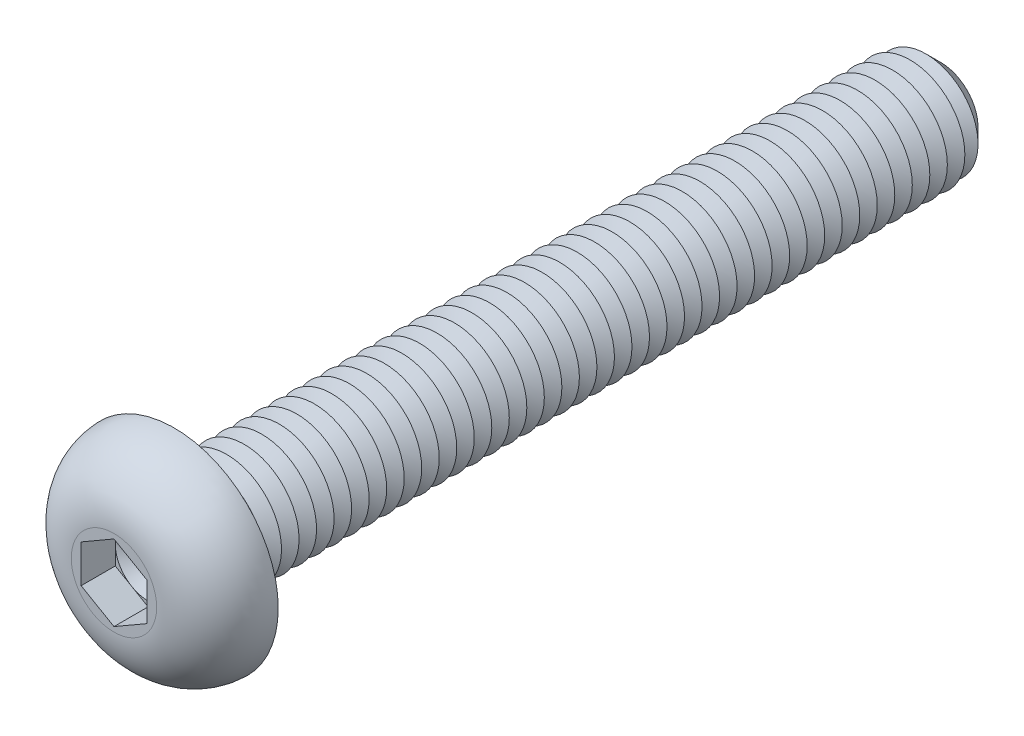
ISO-10303-21;
HEADER;
FILE_DESCRIPTION(('STEP AP214'),'2;1');
FILE_NAME('part.step','',(''),(''),'','','');
FILE_SCHEMA(('AUTOMOTIVE_DESIGN { 1 0 10303 214 1 1 1 1 }'));
ENDSEC;
DATA;
#1=APPLICATION_CONTEXT('core data for automotive mechanical design processes');
#2=APPLICATION_PROTOCOL_DEFINITION('international standard','automotive_design',2000,#1);
#3=PRODUCT_CONTEXT('',#1,'mechanical');
#4=PRODUCT('Part','Part','',(#3));
#5=PRODUCT_RELATED_PRODUCT_CATEGORY('part','',(#4));
#6=PRODUCT_DEFINITION_FORMATION('','',#4);
#7=PRODUCT_DEFINITION_CONTEXT('part definition',#1,'design');
#8=PRODUCT_DEFINITION('design','',#6,#7);
#9=PRODUCT_DEFINITION_SHAPE('','',#8);
#10=(LENGTH_UNIT() NAMED_UNIT(*) SI_UNIT(.MILLI.,.METRE.));
#11=(NAMED_UNIT(*) PLANE_ANGLE_UNIT() SI_UNIT($,.RADIAN.));
#12=(NAMED_UNIT(*) SI_UNIT($,.STERADIAN.) SOLID_ANGLE_UNIT());
#13=UNCERTAINTY_MEASURE_WITH_UNIT(LENGTH_MEASURE(1.E-05),#10,'distance_accuracy_value','');
#14=(GEOMETRIC_REPRESENTATION_CONTEXT(3) GLOBAL_UNCERTAINTY_ASSIGNED_CONTEXT((#13)) GLOBAL_UNIT_ASSIGNED_CONTEXT((#10,
#11,#12)) REPRESENTATION_CONTEXT('',''));
#15=CARTESIAN_POINT('',(0.,0.,0.));
#16=DIRECTION('',(0.,0.,1.));
#17=DIRECTION('',(1.,0.,0.));
#18=AXIS2_PLACEMENT_3D('',#15,#16,#17);
#19=CARTESIAN_POINT('',(0.,0.,1.19));
#20=DIRECTION('',(0.,0.,1.));
#21=DIRECTION('',(1.,0.,0.));
#22=AXIS2_PLACEMENT_3D('',#19,#20,#21);
#23=PLANE('',#22);
#24=CARTESIAN_POINT('',(0.,0.,1.19));
#25=DIRECTION('',(0.,0.,1.));
#26=DIRECTION('',(1.,0.,0.));
#27=AXIS2_PLACEMENT_3D('',#24,#25,#26);
#28=CIRCLE('',#27,1.5);
#29=CARTESIAN_POINT('',(1.5,0.,1.19));
#30=VERTEX_POINT('',#29);
#31=CARTESIAN_POINT('',(0.75,1.29903810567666,1.19));
#32=VERTEX_POINT('',#31);
#33=EDGE_CURVE('E117',#30,#32,#28,.T.);
#34=ORIENTED_EDGE('',*,*,#33,.F.);
#35=DIRECTION('',(0.,1.,0.));
#36=VECTOR('',#35,1.);
#37=CARTESIAN_POINT('',(1.5,-0.866025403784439,1.19));
#38=LINE('',#37,#36);
#39=CARTESIAN_POINT('',(1.5,0.86602540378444,1.19));
#40=VERTEX_POINT('',#39);
#41=EDGE_CURVE('E140',#30,#40,#38,.T.);
#42=ORIENTED_EDGE('',*,*,#41,.T.);
#43=DIRECTION('',(-0.866025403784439,0.5,0.));
#44=VECTOR('',#43,1.);
#45=CARTESIAN_POINT('',(1.5,0.86602540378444,1.19));
#46=LINE('',#45,#44);
#47=EDGE_CURVE('E135',#40,#32,#46,.T.);
#48=ORIENTED_EDGE('',*,*,#47,.T.);
#49=EDGE_LOOP('',(#34,#42,#48));
#50=FACE_BOUND('',#49,.T.);
#51=ADVANCED_FACE('F39',(#50),#23,.T.);
#52=CARTESIAN_POINT('',(0.,0.,1.19));
#53=DIRECTION('',(0.,0.,1.));
#54=DIRECTION('',(1.,0.,0.));
#55=AXIS2_PLACEMENT_3D('',#52,#53,#54);
#56=CIRCLE('',#55,1.5);
#57=CARTESIAN_POINT('',(-0.75,1.29903810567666,1.19));
#58=VERTEX_POINT('',#57);
#59=EDGE_CURVE('E11',#32,#58,#56,.T.);
#60=ORIENTED_EDGE('',*,*,#59,.F.);
#61=CARTESIAN_POINT('',(0.,1.73205080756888,1.19));
#62=VERTEX_POINT('',#61);
#63=EDGE_CURVE('E130',#32,#62,#46,.T.);
#64=ORIENTED_EDGE('',*,*,#63,.T.);
#65=DIRECTION('',(-0.866025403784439,-0.5,0.));
#66=VECTOR('',#65,1.);
#67=CARTESIAN_POINT('',(0.,1.73205080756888,1.19));
#68=LINE('',#67,#66);
#69=EDGE_CURVE('E132',#62,#58,#68,.T.);
#70=ORIENTED_EDGE('',*,*,#69,.T.);
#71=EDGE_LOOP('',(#60,#64,#70));
#72=FACE_BOUND('',#71,.T.);
#73=ADVANCED_FACE('F129',(#72),#23,.T.);
#74=CARTESIAN_POINT('',(-1.5,0.,1.19));
#75=VERTEX_POINT('',#74);
#76=EDGE_CURVE('E49',#58,#75,#56,.T.);
#77=ORIENTED_EDGE('',*,*,#76,.F.);
#78=CARTESIAN_POINT('',(-1.5,0.866025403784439,1.19));
#79=VERTEX_POINT('',#78);
#80=EDGE_CURVE('E143',#58,#79,#68,.T.);
#81=ORIENTED_EDGE('',*,*,#80,.T.);
#82=DIRECTION('',(0.,-1.,0.));
#83=VECTOR('',#82,1.);
#84=CARTESIAN_POINT('',(-1.5,0.866025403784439,1.19));
#85=LINE('',#84,#83);
#86=EDGE_CURVE('E154',#79,#75,#85,.T.);
#87=ORIENTED_EDGE('',*,*,#86,.T.);
#88=EDGE_LOOP('',(#77,#81,#87));
#89=FACE_BOUND('',#88,.T.);
#90=ADVANCED_FACE('F260',(#89),#23,.T.);
#91=CARTESIAN_POINT('',(-0.75,-1.29903810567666,1.19));
#92=VERTEX_POINT('',#91);
#93=EDGE_CURVE('E242',#75,#92,#56,.T.);
#94=ORIENTED_EDGE('',*,*,#93,.F.);
#95=CARTESIAN_POINT('',(-1.5,-0.866025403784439,1.19));
#96=VERTEX_POINT('',#95);
#97=EDGE_CURVE('E153',#75,#96,#85,.T.);
#98=ORIENTED_EDGE('',*,*,#97,.T.);
#99=DIRECTION('',(0.866025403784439,-0.5,0.));
#100=VECTOR('',#99,1.);
#101=CARTESIAN_POINT('',(-1.5,-0.866025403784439,1.19));
#102=LINE('',#101,#100);
#103=EDGE_CURVE('E159',#96,#92,#102,.T.);
#104=ORIENTED_EDGE('',*,*,#103,.T.);
#105=EDGE_LOOP('',(#94,#98,#104));
#106=FACE_BOUND('',#105,.T.);
#107=ADVANCED_FACE('F253',(#106),#23,.T.);
#108=CARTESIAN_POINT('',(0.75,-1.29903810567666,1.19));
#109=VERTEX_POINT('',#108);
#110=EDGE_CURVE('E56',#92,#109,#56,.T.);
#111=ORIENTED_EDGE('',*,*,#110,.F.);
#112=CARTESIAN_POINT('',(0.,-1.73205080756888,1.19));
#113=VERTEX_POINT('',#112);
#114=EDGE_CURVE('E158',#92,#113,#102,.T.);
#115=ORIENTED_EDGE('',*,*,#114,.T.);
#116=DIRECTION('',(0.866025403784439,0.5,0.));
#117=VECTOR('',#116,1.);
#118=CARTESIAN_POINT('',(0.,-1.73205080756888,1.19));
#119=LINE('',#118,#117);
#120=EDGE_CURVE('E164',#113,#109,#119,.T.);
#121=ORIENTED_EDGE('',*,*,#120,.T.);
#122=EDGE_LOOP('',(#111,#115,#121));
#123=FACE_BOUND('',#122,.T.);
#124=ADVANCED_FACE('F603',(#123),#23,.T.);
#125=CARTESIAN_POINT('',(0.,0.,-35.));
#126=DIRECTION('',(0.,0.,1.));
#127=DIRECTION('',(1.,0.,0.));
#128=AXIS2_PLACEMENT_3D('',#125,#126,#127);
#129=CYLINDRICAL_SURFACE('',#128,2.5);
#130=CARTESIAN_POINT('',(0.,0.,-0.399999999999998));
#131=DIRECTION('',(0.,0.,1.));
#132=DIRECTION('',(1.,0.,0.));
#133=AXIS2_PLACEMENT_3D('',#130,#131,#132);
#134=CIRCLE('',#133,2.5);
#135=CARTESIAN_POINT('',(2.5,0.,-0.399999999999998));
#136=VERTEX_POINT('',#135);
#137=EDGE_CURVE('E222',#136,#136,#134,.F.);
#138=ORIENTED_EDGE('',*,*,#137,.T.);
#139=EDGE_LOOP('',(#138));
#140=FACE_BOUND('',#139,.T.);
#141=CARTESIAN_POINT('',(0.,0.,-0.800000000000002));
#142=DIRECTION('',(0.,0.,1.));
#143=DIRECTION('',(1.,0.,0.));
#144=AXIS2_PLACEMENT_3D('',#141,#142,#143);
#145=CIRCLE('',#144,2.5);
#146=CARTESIAN_POINT('',(2.5,0.,-0.800000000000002));
#147=VERTEX_POINT('',#146);
#148=EDGE_CURVE('E149',#147,#147,#145,.T.);
#149=ORIENTED_EDGE('',*,*,#148,.T.);
#150=EDGE_LOOP('',(#149));
#151=FACE_BOUND('',#150,.T.);
#152=ADVANCED_FACE('F587',(#140,#151),#129,.T.);
#153=CARTESIAN_POINT('',(0.,4.75,0.));
#154=DIRECTION('',(0.,0.,1.));
#155=DIRECTION('',(1.,0.,0.));
#156=AXIS2_PLACEMENT_3D('',#153,#154,#155);
#157=PLANE('',#156);
#158=CARTESIAN_POINT('',(0.,0.,0.));
#159=DIRECTION('',(0.,0.,1.));
#160=DIRECTION('',(1.,0.,0.));
#161=AXIS2_PLACEMENT_3D('',#158,#159,#160);
#162=CIRCLE('',#161,2.9);
#163=CARTESIAN_POINT('',(2.9,0.,0.));
#164=VERTEX_POINT('',#163);
#165=EDGE_CURVE('E231',#164,#164,#162,.T.);
#166=ORIENTED_EDGE('',*,*,#165,.T.);
#167=EDGE_LOOP('',(#166));
#168=FACE_BOUND('',#167,.T.);
#169=CARTESIAN_POINT('',(0.,0.,0.));
#170=DIRECTION('',(0.,0.,1.));
#171=DIRECTION('',(1.,0.,0.));
#172=AXIS2_PLACEMENT_3D('',#169,#170,#171);
#173=CIRCLE('',#172,4.75);
#174=CARTESIAN_POINT('',(4.75,0.,0.));
#175=VERTEX_POINT('',#174);
#176=EDGE_CURVE('E196',#175,#175,#173,.T.);
#177=ORIENTED_EDGE('',*,*,#176,.F.);
#178=EDGE_LOOP('',(#177));
#179=FACE_BOUND('',#178,.T.);
#180=ADVANCED_FACE('F633',(#168,#179),#157,.F.);
#181=CARTESIAN_POINT('',(0.,0.,2.75));
#182=DIRECTION('',(0.,0.,-1.));
#183=DIRECTION('',(-1.,0.,0.));
#184=AXIS2_PLACEMENT_3D('',#181,#182,#183);
#185=PLANE('',#184);
#186=DIRECTION('',(-0.866025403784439,-0.5,0.));
#187=VECTOR('',#186,1.);
#188=CARTESIAN_POINT('',(0.,1.73205080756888,2.75));
#189=LINE('',#188,#187);
#190=CARTESIAN_POINT('',(0.,1.73205080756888,2.75));
#191=VERTEX_POINT('',#190);
#192=CARTESIAN_POINT('',(-1.5,0.866025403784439,2.75));
#193=VERTEX_POINT('',#192);
#194=EDGE_CURVE('E174',#191,#193,#189,.T.);
#195=ORIENTED_EDGE('',*,*,#194,.F.);
#196=DIRECTION('',(-0.866025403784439,0.5,0.));
#197=VECTOR('',#196,1.);
#198=CARTESIAN_POINT('',(1.5,0.86602540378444,2.75));
#199=LINE('',#198,#197);
#200=CARTESIAN_POINT('',(1.5,0.86602540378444,2.75));
#201=VERTEX_POINT('',#200);
#202=EDGE_CURVE('E64',#201,#191,#199,.T.);
#203=ORIENTED_EDGE('',*,*,#202,.F.);
#204=DIRECTION('',(0.,1.,0.));
#205=VECTOR('',#204,1.);
#206=CARTESIAN_POINT('',(1.5,-0.866025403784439,2.75));
#207=LINE('',#206,#205);
#208=CARTESIAN_POINT('',(1.5,-0.866025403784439,2.75));
#209=VERTEX_POINT('',#208);
#210=EDGE_CURVE('E138',#209,#201,#207,.T.);
#211=ORIENTED_EDGE('',*,*,#210,.F.);
#212=DIRECTION('',(0.866025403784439,0.5,0.));
#213=VECTOR('',#212,1.);
#214=CARTESIAN_POINT('',(0.,-1.73205080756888,2.75));
#215=LINE('',#214,#213);
#216=CARTESIAN_POINT('',(0.,-1.73205080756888,2.75));
#217=VERTEX_POINT('',#216);
#218=EDGE_CURVE('E186',#217,#209,#215,.T.);
#219=ORIENTED_EDGE('',*,*,#218,.F.);
#220=DIRECTION('',(0.866025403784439,-0.5,0.));
#221=VECTOR('',#220,1.);
#222=CARTESIAN_POINT('',(-1.5,-0.866025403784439,2.75));
#223=LINE('',#222,#221);
#224=CARTESIAN_POINT('',(-1.5,-0.866025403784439,2.75));
#225=VERTEX_POINT('',#224);
#226=EDGE_CURVE('E182',#225,#217,#223,.T.);
#227=ORIENTED_EDGE('',*,*,#226,.F.);
#228=DIRECTION('',(0.,-1.,0.));
#229=VECTOR('',#228,1.);
#230=CARTESIAN_POINT('',(-1.5,0.866025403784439,2.75));
#231=LINE('',#230,#229);
#232=EDGE_CURVE('E178',#193,#225,#231,.T.);
#233=ORIENTED_EDGE('',*,*,#232,.F.);
#234=EDGE_LOOP('',(#195,#203,#211,#219,#227,#233));
#235=FACE_BOUND('',#234,.T.);
#236=CARTESIAN_POINT('',(0.,0.,2.75));
#237=DIRECTION('',(0.,0.,1.));
#238=DIRECTION('',(1.,0.,0.));
#239=AXIS2_PLACEMENT_3D('',#236,#237,#238);
#240=CIRCLE('',#239,1.95044646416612);
#241=CARTESIAN_POINT('',(1.95044646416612,0.,2.75));
#242=VERTEX_POINT('',#241);
#243=EDGE_CURVE('E214',#242,#242,#240,.T.);
#244=ORIENTED_EDGE('',*,*,#243,.T.);
#245=EDGE_LOOP('',(#244));
#246=FACE_BOUND('',#245,.T.);
#247=ADVANCED_FACE('F269',(#235,#246),#185,.F.);
#248=CARTESIAN_POINT('',(0.,0.,-0.0500000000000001));
#249=DIRECTION('',(0.,0.,1.));
#250=DIRECTION('',(1.,0.,0.));
#251=AXIS2_PLACEMENT_3D('',#248,#249,#250);
#252=DEGENERATE_TOROIDAL_SURFACE('',#251,1.95044646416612,2.8,.T.);
#253=ORIENTED_EDGE('',*,*,#243,.F.);
#254=EDGE_LOOP('',(#253));
#255=FACE_BOUND('',#254,.T.);
#256=ORIENTED_EDGE('',*,*,#176,.T.);
#257=EDGE_LOOP('',(#256));
#258=FACE_BOUND('',#257,.T.);
#259=ADVANCED_FACE('F627',(#255,#258),#252,.T.);
#260=CARTESIAN_POINT('',(1.5,0.86602540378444,1.19));
#261=DIRECTION('',(0.5,0.866025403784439,0.));
#262=DIRECTION('',(-0.866025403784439,0.5,0.));
#263=AXIS2_PLACEMENT_3D('',#260,#261,#262);
#264=PLANE('',#263);
#265=ORIENTED_EDGE('',*,*,#202,.T.);
#266=DIRECTION('',(0.,0.,1.));
#267=VECTOR('',#266,1.);
#268=CARTESIAN_POINT('',(0.,1.73205080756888,1.19));
#269=LINE('',#268,#267);
#270=EDGE_CURVE('E136',#62,#191,#269,.T.);
#271=ORIENTED_EDGE('',*,*,#270,.F.);
#272=ORIENTED_EDGE('',*,*,#63,.F.);
#273=ORIENTED_EDGE('',*,*,#47,.F.);
#274=DIRECTION('',(0.,0.,1.));
#275=VECTOR('',#274,1.);
#276=CARTESIAN_POINT('',(1.5,0.86602540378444,1.19));
#277=LINE('',#276,#275);
#278=EDGE_CURVE('E193',#40,#201,#277,.T.);
#279=ORIENTED_EDGE('',*,*,#278,.T.);
#280=EDGE_LOOP('',(#265,#271,#272,#273,#279));
#281=FACE_BOUND('',#280,.T.);
#282=ADVANCED_FACE('F134',(#281),#264,.F.);
#283=CARTESIAN_POINT('',(1.5,-0.866025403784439,1.19));
#284=DIRECTION('',(1.,0.,0.));
#285=DIRECTION('',(0.,1.,0.));
#286=AXIS2_PLACEMENT_3D('',#283,#284,#285);
#287=PLANE('',#286);
#288=ORIENTED_EDGE('',*,*,#210,.T.);
#289=ORIENTED_EDGE('',*,*,#278,.F.);
#290=ORIENTED_EDGE('',*,*,#41,.F.);
#291=CARTESIAN_POINT('',(1.5,-0.866025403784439,1.19));
#292=VERTEX_POINT('',#291);
#293=EDGE_CURVE('E168',#292,#30,#38,.T.);
#294=ORIENTED_EDGE('',*,*,#293,.F.);
#295=DIRECTION('',(0.,0.,1.));
#296=VECTOR('',#295,1.);
#297=CARTESIAN_POINT('',(1.5,-0.866025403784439,1.19));
#298=LINE('',#297,#296);
#299=EDGE_CURVE('E197',#292,#209,#298,.T.);
#300=ORIENTED_EDGE('',*,*,#299,.T.);
#301=EDGE_LOOP('',(#288,#289,#290,#294,#300));
#302=FACE_BOUND('',#301,.T.);
#303=ADVANCED_FACE('F611',(#302),#287,.F.);
#304=CARTESIAN_POINT('',(0.,-1.73205080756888,1.19));
#305=DIRECTION('',(0.5,-0.866025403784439,0.));
#306=DIRECTION('',(0.866025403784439,0.5,0.));
#307=AXIS2_PLACEMENT_3D('',#304,#305,#306);
#308=PLANE('',#307);
#309=ORIENTED_EDGE('',*,*,#218,.T.);
#310=ORIENTED_EDGE('',*,*,#299,.F.);
#311=EDGE_CURVE('E163',#109,#292,#119,.T.);
#312=ORIENTED_EDGE('',*,*,#311,.F.);
#313=ORIENTED_EDGE('',*,*,#120,.F.);
#314=DIRECTION('',(0.,0.,1.));
#315=VECTOR('',#314,1.);
#316=CARTESIAN_POINT('',(0.,-1.73205080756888,1.19));
#317=LINE('',#316,#315);
#318=EDGE_CURVE('E200',#113,#217,#317,.T.);
#319=ORIENTED_EDGE('',*,*,#318,.T.);
#320=EDGE_LOOP('',(#309,#310,#312,#313,#319));
#321=FACE_BOUND('',#320,.T.);
#322=ADVANCED_FACE('F614',(#321),#308,.F.);
#323=CARTESIAN_POINT('',(-1.5,-0.866025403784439,1.19));
#324=DIRECTION('',(-0.5,-0.866025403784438,0.));
#325=DIRECTION('',(0.866025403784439,-0.5,0.));
#326=AXIS2_PLACEMENT_3D('',#323,#324,#325);
#327=PLANE('',#326);
#328=ORIENTED_EDGE('',*,*,#226,.T.);
#329=ORIENTED_EDGE('',*,*,#318,.F.);
#330=ORIENTED_EDGE('',*,*,#114,.F.);
#331=ORIENTED_EDGE('',*,*,#103,.F.);
#332=DIRECTION('',(0.,0.,1.));
#333=VECTOR('',#332,1.);
#334=CARTESIAN_POINT('',(-1.5,-0.866025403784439,1.19));
#335=LINE('',#334,#333);
#336=EDGE_CURVE('E203',#96,#225,#335,.T.);
#337=ORIENTED_EDGE('',*,*,#336,.T.);
#338=EDGE_LOOP('',(#328,#329,#330,#331,#337));
#339=FACE_BOUND('',#338,.T.);
#340=ADVANCED_FACE('F274',(#339),#327,.F.);
#341=CARTESIAN_POINT('',(-1.5,0.866025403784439,1.19));
#342=DIRECTION('',(-1.,0.,0.));
#343=DIRECTION('',(0.,-1.,0.));
#344=AXIS2_PLACEMENT_3D('',#341,#342,#343);
#345=PLANE('',#344);
#346=ORIENTED_EDGE('',*,*,#232,.T.);
#347=ORIENTED_EDGE('',*,*,#336,.F.);
#348=ORIENTED_EDGE('',*,*,#97,.F.);
#349=ORIENTED_EDGE('',*,*,#86,.F.);
#350=DIRECTION('',(0.,0.,1.));
#351=VECTOR('',#350,1.);
#352=CARTESIAN_POINT('',(-1.5,0.866025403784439,1.19));
#353=LINE('',#352,#351);
#354=EDGE_CURVE('E206',#79,#193,#353,.T.);
#355=ORIENTED_EDGE('',*,*,#354,.T.);
#356=EDGE_LOOP('',(#346,#347,#348,#349,#355));
#357=FACE_BOUND('',#356,.T.);
#358=ADVANCED_FACE('F258',(#357),#345,.F.);
#359=CARTESIAN_POINT('',(0.,1.73205080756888,1.19));
#360=DIRECTION('',(-0.5,0.866025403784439,0.));
#361=DIRECTION('',(-0.866025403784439,-0.5,0.));
#362=AXIS2_PLACEMENT_3D('',#359,#360,#361);
#363=PLANE('',#362);
#364=ORIENTED_EDGE('',*,*,#194,.T.);
#365=ORIENTED_EDGE('',*,*,#354,.F.);
#366=ORIENTED_EDGE('',*,*,#80,.F.);
#367=ORIENTED_EDGE('',*,*,#69,.F.);
#368=ORIENTED_EDGE('',*,*,#270,.T.);
#369=EDGE_LOOP('',(#364,#365,#366,#367,#368));
#370=FACE_BOUND('',#369,.T.);
#371=ADVANCED_FACE('F263',(#370),#363,.F.);
#372=EDGE_CURVE('E43',#109,#30,#56,.T.);
#373=ORIENTED_EDGE('',*,*,#372,.F.);
#374=ORIENTED_EDGE('',*,*,#311,.T.);
#375=ORIENTED_EDGE('',*,*,#293,.T.);
#376=EDGE_LOOP('',(#373,#374,#375));
#377=FACE_BOUND('',#376,.T.);
#378=ADVANCED_FACE('F592',(#377),#23,.T.);
#379=CARTESIAN_POINT('',(0.,0.,-0.800000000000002));
#380=DIRECTION('',(0.,0.,1.));
#381=DIRECTION('',(1.,0.,0.));
#382=AXIS2_PLACEMENT_3D('',#379,#380,#381);
#383=CONICAL_SURFACE('',#382,2.5,1.0471975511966);
#384=CARTESIAN_POINT('',(0.,0.,-1.2));
#385=DIRECTION('',(0.,0.,1.));
#386=DIRECTION('',(1.,0.,0.));
#387=AXIS2_PLACEMENT_3D('',#384,#385,#386);
#388=CIRCLE('',#387,1.80717967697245);
#389=CARTESIAN_POINT('',(1.80717967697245,0.,-1.2));
#390=VERTEX_POINT('',#389);
#391=EDGE_CURVE('E580',#390,#390,#388,.T.);
#392=ORIENTED_EDGE('',*,*,#391,.T.);
#393=EDGE_LOOP('',(#392));
#394=FACE_BOUND('',#393,.T.);
#395=ORIENTED_EDGE('',*,*,#148,.F.);
#396=EDGE_LOOP('',(#395));
#397=FACE_BOUND('',#396,.T.);
#398=ADVANCED_FACE('F589',(#394,#397),#383,.T.);
#399=CARTESIAN_POINT('',(0.,0.,-1.2));
#400=DIRECTION('',(0.,0.,-1.));
#401=DIRECTION('',(-1.,0.,0.));
#402=AXIS2_PLACEMENT_3D('',#399,#400,#401);
#403=CONICAL_SURFACE('',#402,1.80717967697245,1.04719755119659);
#404=CARTESIAN_POINT('',(0.,0.,-1.6));
#405=DIRECTION('',(0.,0.,1.));
#406=DIRECTION('',(1.,0.,0.));
#407=AXIS2_PLACEMENT_3D('',#404,#405,#406);
#408=CIRCLE('',#407,2.5);
#409=CARTESIAN_POINT('',(2.5,0.,-1.6));
#410=VERTEX_POINT('',#409);
#411=EDGE_CURVE('E577',#410,#410,#408,.T.);
#412=ORIENTED_EDGE('',*,*,#411,.T.);
#413=EDGE_LOOP('',(#412));
#414=FACE_BOUND('',#413,.T.);
#415=ORIENTED_EDGE('',*,*,#391,.F.);
#416=EDGE_LOOP('',(#415));
#417=FACE_BOUND('',#416,.T.);
#418=ADVANCED_FACE('F591',(#414,#417),#403,.T.);
#419=CARTESIAN_POINT('',(0.,0.,-1.6));
#420=DIRECTION('',(0.,0.,1.));
#421=DIRECTION('',(1.,0.,0.));
#422=AXIS2_PLACEMENT_3D('',#419,#420,#421);
#423=CONICAL_SURFACE('',#422,2.5,1.0471975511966);
#424=CARTESIAN_POINT('',(0.,0.,-2.));
#425=DIRECTION('',(0.,0.,1.));
#426=DIRECTION('',(1.,0.,0.));
#427=AXIS2_PLACEMENT_3D('',#424,#425,#426);
#428=CIRCLE('',#427,1.80717967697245);
#429=CARTESIAN_POINT('',(1.80717967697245,0.,-2.));
#430=VERTEX_POINT('',#429);
#431=EDGE_CURVE('E573',#430,#430,#428,.T.);
#432=ORIENTED_EDGE('',*,*,#431,.T.);
#433=EDGE_LOOP('',(#432));
#434=FACE_BOUND('',#433,.T.);
#435=ORIENTED_EDGE('',*,*,#411,.F.);
#436=EDGE_LOOP('',(#435));
#437=FACE_BOUND('',#436,.T.);
#438=ADVANCED_FACE('F598',(#434,#437),#423,.T.);
#439=CARTESIAN_POINT('',(0.,0.,-2.));
#440=DIRECTION('',(0.,0.,-1.));
#441=DIRECTION('',(-1.,0.,0.));
#442=AXIS2_PLACEMENT_3D('',#439,#440,#441);
#443=CONICAL_SURFACE('',#442,1.80717967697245,1.04719755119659);
#444=CARTESIAN_POINT('',(0.,0.,-2.4));
#445=DIRECTION('',(0.,0.,1.));
#446=DIRECTION('',(1.,0.,0.));
#447=AXIS2_PLACEMENT_3D('',#444,#445,#446);
#448=CIRCLE('',#447,2.5);
#449=CARTESIAN_POINT('',(2.5,0.,-2.4));
#450=VERTEX_POINT('',#449);
#451=EDGE_CURVE('E569',#450,#450,#448,.T.);
#452=ORIENTED_EDGE('',*,*,#451,.T.);
#453=EDGE_LOOP('',(#452));
#454=FACE_BOUND('',#453,.T.);
#455=ORIENTED_EDGE('',*,*,#431,.F.);
#456=EDGE_LOOP('',(#455));
#457=FACE_BOUND('',#456,.T.);
#458=ADVANCED_FACE('F982',(#454,#457),#443,.T.);
#459=CARTESIAN_POINT('',(0.,0.,-2.4));
#460=DIRECTION('',(0.,0.,1.));
#461=DIRECTION('',(1.,0.,0.));
#462=AXIS2_PLACEMENT_3D('',#459,#460,#461);
#463=CONICAL_SURFACE('',#462,2.5,1.0471975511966);
#464=CARTESIAN_POINT('',(0.,0.,-2.8));
#465=DIRECTION('',(0.,0.,1.));
#466=DIRECTION('',(1.,0.,0.));
#467=AXIS2_PLACEMENT_3D('',#464,#465,#466);
#468=CIRCLE('',#467,1.80717967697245);
#469=CARTESIAN_POINT('',(1.80717967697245,0.,-2.8));
#470=VERTEX_POINT('',#469);
#471=EDGE_CURVE('E566',#470,#470,#468,.T.);
#472=ORIENTED_EDGE('',*,*,#471,.T.);
#473=EDGE_LOOP('',(#472));
#474=FACE_BOUND('',#473,.T.);
#475=ORIENTED_EDGE('',*,*,#451,.F.);
#476=EDGE_LOOP('',(#475));
#477=FACE_BOUND('',#476,.T.);
#478=ADVANCED_FACE('F978',(#474,#477),#463,.T.);
#479=CARTESIAN_POINT('',(0.,0.,-2.8));
#480=DIRECTION('',(0.,0.,-1.));
#481=DIRECTION('',(-1.,0.,0.));
#482=AXIS2_PLACEMENT_3D('',#479,#480,#481);
#483=CONICAL_SURFACE('',#482,1.80717967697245,1.04719755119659);
#484=CARTESIAN_POINT('',(0.,0.,-3.2));
#485=DIRECTION('',(0.,0.,1.));
#486=DIRECTION('',(1.,0.,0.));
#487=AXIS2_PLACEMENT_3D('',#484,#485,#486);
#488=CIRCLE('',#487,2.5);
#489=CARTESIAN_POINT('',(2.5,0.,-3.2));
#490=VERTEX_POINT('',#489);
#491=EDGE_CURVE('E562',#490,#490,#488,.T.);
#492=ORIENTED_EDGE('',*,*,#491,.T.);
#493=EDGE_LOOP('',(#492));
#494=FACE_BOUND('',#493,.T.);
#495=ORIENTED_EDGE('',*,*,#471,.F.);
#496=EDGE_LOOP('',(#495));
#497=FACE_BOUND('',#496,.T.);
#498=ADVANCED_FACE('F974',(#494,#497),#483,.T.);
#499=CARTESIAN_POINT('',(0.,0.,-3.2));
#500=DIRECTION('',(0.,0.,1.));
#501=DIRECTION('',(1.,0.,0.));
#502=AXIS2_PLACEMENT_3D('',#499,#500,#501);
#503=CONICAL_SURFACE('',#502,2.5,1.0471975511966);
#504=CARTESIAN_POINT('',(0.,0.,-3.6));
#505=DIRECTION('',(0.,0.,1.));
#506=DIRECTION('',(1.,0.,0.));
#507=AXIS2_PLACEMENT_3D('',#504,#505,#506);
#508=CIRCLE('',#507,1.80717967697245);
#509=CARTESIAN_POINT('',(1.80717967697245,0.,-3.6));
#510=VERTEX_POINT('',#509);
#511=EDGE_CURVE('E309',#510,#510,#508,.T.);
#512=ORIENTED_EDGE('',*,*,#511,.T.);
#513=EDGE_LOOP('',(#512));
#514=FACE_BOUND('',#513,.T.);
#515=ORIENTED_EDGE('',*,*,#491,.F.);
#516=EDGE_LOOP('',(#515));
#517=FACE_BOUND('',#516,.T.);
#518=ADVANCED_FACE('F970',(#514,#517),#503,.T.);
#519=CARTESIAN_POINT('',(0.,0.,-3.6));
#520=DIRECTION('',(0.,0.,-1.));
#521=DIRECTION('',(-1.,0.,0.));
#522=AXIS2_PLACEMENT_3D('',#519,#520,#521);
#523=CONICAL_SURFACE('',#522,1.80717967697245,1.04719755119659);
#524=CARTESIAN_POINT('',(0.,0.,-4.));
#525=DIRECTION('',(0.,0.,1.));
#526=DIRECTION('',(1.,0.,0.));
#527=AXIS2_PLACEMENT_3D('',#524,#525,#526);
#528=CIRCLE('',#527,2.5);
#529=CARTESIAN_POINT('',(2.5,0.,-4.));
#530=VERTEX_POINT('',#529);
#531=EDGE_CURVE('E306',#530,#530,#528,.T.);
#532=ORIENTED_EDGE('',*,*,#531,.T.);
#533=EDGE_LOOP('',(#532));
#534=FACE_BOUND('',#533,.T.);
#535=ORIENTED_EDGE('',*,*,#511,.F.);
#536=EDGE_LOOP('',(#535));
#537=FACE_BOUND('',#536,.T.);
#538=ADVANCED_FACE('F966',(#534,#537),#523,.T.);
#539=CARTESIAN_POINT('',(0.,0.,-4.));
#540=DIRECTION('',(0.,0.,1.));
#541=DIRECTION('',(1.,0.,0.));
#542=AXIS2_PLACEMENT_3D('',#539,#540,#541);
#543=CONICAL_SURFACE('',#542,2.5,1.0471975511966);
#544=CARTESIAN_POINT('',(0.,0.,-4.4));
#545=DIRECTION('',(0.,0.,1.));
#546=DIRECTION('',(1.,0.,0.));
#547=AXIS2_PLACEMENT_3D('',#544,#545,#546);
#548=CIRCLE('',#547,1.80717967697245);
#549=CARTESIAN_POINT('',(1.80717967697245,0.,-4.4));
#550=VERTEX_POINT('',#549);
#551=EDGE_CURVE('E310',#550,#550,#548,.T.);
#552=ORIENTED_EDGE('',*,*,#551,.T.);
#553=EDGE_LOOP('',(#552));
#554=FACE_BOUND('',#553,.T.);
#555=ORIENTED_EDGE('',*,*,#531,.F.);
#556=EDGE_LOOP('',(#555));
#557=FACE_BOUND('',#556,.T.);
#558=ADVANCED_FACE('F962',(#554,#557),#543,.T.);
#559=CARTESIAN_POINT('',(0.,0.,-4.4));
#560=DIRECTION('',(0.,0.,-1.));
#561=DIRECTION('',(-1.,0.,0.));
#562=AXIS2_PLACEMENT_3D('',#559,#560,#561);
#563=CONICAL_SURFACE('',#562,1.80717967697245,1.04719755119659);
#564=CARTESIAN_POINT('',(0.,0.,-4.8));
#565=DIRECTION('',(0.,0.,1.));
#566=DIRECTION('',(1.,0.,0.));
#567=AXIS2_PLACEMENT_3D('',#564,#565,#566);
#568=CIRCLE('',#567,2.5);
#569=CARTESIAN_POINT('',(2.5,0.,-4.8));
#570=VERTEX_POINT('',#569);
#571=EDGE_CURVE('E358',#570,#570,#568,.T.);
#572=ORIENTED_EDGE('',*,*,#571,.T.);
#573=EDGE_LOOP('',(#572));
#574=FACE_BOUND('',#573,.T.);
#575=ORIENTED_EDGE('',*,*,#551,.F.);
#576=EDGE_LOOP('',(#575));
#577=FACE_BOUND('',#576,.T.);
#578=ADVANCED_FACE('F958',(#574,#577),#563,.T.);
#579=CARTESIAN_POINT('',(0.,0.,-4.8));
#580=DIRECTION('',(0.,0.,1.));
#581=DIRECTION('',(1.,0.,0.));
#582=AXIS2_PLACEMENT_3D('',#579,#580,#581);
#583=CONICAL_SURFACE('',#582,2.5,1.0471975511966);
#584=CARTESIAN_POINT('',(0.,0.,-5.2));
#585=DIRECTION('',(0.,0.,1.));
#586=DIRECTION('',(1.,0.,0.));
#587=AXIS2_PLACEMENT_3D('',#584,#585,#586);
#588=CIRCLE('',#587,1.80717967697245);
#589=CARTESIAN_POINT('',(1.80717967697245,0.,-5.2));
#590=VERTEX_POINT('',#589);
#591=EDGE_CURVE('E355',#590,#590,#588,.T.);
#592=ORIENTED_EDGE('',*,*,#591,.T.);
#593=EDGE_LOOP('',(#592));
#594=FACE_BOUND('',#593,.T.);
#595=ORIENTED_EDGE('',*,*,#571,.F.);
#596=EDGE_LOOP('',(#595));
#597=FACE_BOUND('',#596,.T.);
#598=ADVANCED_FACE('F954',(#594,#597),#583,.T.);
#599=CARTESIAN_POINT('',(0.,0.,-5.2));
#600=DIRECTION('',(0.,0.,-1.));
#601=DIRECTION('',(-1.,0.,0.));
#602=AXIS2_PLACEMENT_3D('',#599,#600,#601);
#603=CONICAL_SURFACE('',#602,1.80717967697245,1.04719755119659);
#604=CARTESIAN_POINT('',(0.,0.,-5.6));
#605=DIRECTION('',(0.,0.,1.));
#606=DIRECTION('',(1.,0.,0.));
#607=AXIS2_PLACEMENT_3D('',#604,#605,#606);
#608=CIRCLE('',#607,2.5);
#609=CARTESIAN_POINT('',(2.5,0.,-5.6));
#610=VERTEX_POINT('',#609);
#611=EDGE_CURVE('E359',#610,#610,#608,.T.);
#612=ORIENTED_EDGE('',*,*,#611,.T.);
#613=EDGE_LOOP('',(#612));
#614=FACE_BOUND('',#613,.T.);
#615=ORIENTED_EDGE('',*,*,#591,.F.);
#616=EDGE_LOOP('',(#615));
#617=FACE_BOUND('',#616,.T.);
#618=ADVANCED_FACE('F950',(#614,#617),#603,.T.);
#619=CARTESIAN_POINT('',(0.,0.,-5.6));
#620=DIRECTION('',(0.,0.,1.));
#621=DIRECTION('',(1.,0.,0.));
#622=AXIS2_PLACEMENT_3D('',#619,#620,#621);
#623=CONICAL_SURFACE('',#622,2.5,1.0471975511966);
#624=CARTESIAN_POINT('',(0.,0.,-6.));
#625=DIRECTION('',(0.,0.,1.));
#626=DIRECTION('',(1.,0.,0.));
#627=AXIS2_PLACEMENT_3D('',#624,#625,#626);
#628=CIRCLE('',#627,1.80717967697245);
#629=CARTESIAN_POINT('',(1.80717967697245,0.,-6.));
#630=VERTEX_POINT('',#629);
#631=EDGE_CURVE('E546',#630,#630,#628,.T.);
#632=ORIENTED_EDGE('',*,*,#631,.T.);
#633=EDGE_LOOP('',(#632));
#634=FACE_BOUND('',#633,.T.);
#635=ORIENTED_EDGE('',*,*,#611,.F.);
#636=EDGE_LOOP('',(#635));
#637=FACE_BOUND('',#636,.T.);
#638=ADVANCED_FACE('F946',(#634,#637),#623,.T.);
#639=CARTESIAN_POINT('',(0.,0.,-6.));
#640=DIRECTION('',(0.,0.,-1.));
#641=DIRECTION('',(-1.,0.,0.));
#642=AXIS2_PLACEMENT_3D('',#639,#640,#641);
#643=CONICAL_SURFACE('',#642,1.80717967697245,1.04719755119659);
#644=CARTESIAN_POINT('',(0.,0.,-6.4));
#645=DIRECTION('',(0.,0.,1.));
#646=DIRECTION('',(1.,0.,0.));
#647=AXIS2_PLACEMENT_3D('',#644,#645,#646);
#648=CIRCLE('',#647,2.5);
#649=CARTESIAN_POINT('',(2.5,0.,-6.4));
#650=VERTEX_POINT('',#649);
#651=EDGE_CURVE('E315',#650,#650,#648,.T.);
#652=ORIENTED_EDGE('',*,*,#651,.T.);
#653=EDGE_LOOP('',(#652));
#654=FACE_BOUND('',#653,.T.);
#655=ORIENTED_EDGE('',*,*,#631,.F.);
#656=EDGE_LOOP('',(#655));
#657=FACE_BOUND('',#656,.T.);
#658=ADVANCED_FACE('F942',(#654,#657),#643,.T.);
#659=CARTESIAN_POINT('',(0.,0.,-6.4));
#660=DIRECTION('',(0.,0.,1.));
#661=DIRECTION('',(1.,0.,0.));
#662=AXIS2_PLACEMENT_3D('',#659,#660,#661);
#663=CONICAL_SURFACE('',#662,2.5,1.0471975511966);
#664=CARTESIAN_POINT('',(0.,0.,-6.8));
#665=DIRECTION('',(0.,0.,1.));
#666=DIRECTION('',(1.,0.,0.));
#667=AXIS2_PLACEMENT_3D('',#664,#665,#666);
#668=CIRCLE('',#667,1.80717967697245);
#669=CARTESIAN_POINT('',(1.80717967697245,0.,-6.8));
#670=VERTEX_POINT('',#669);
#671=EDGE_CURVE('E312',#670,#670,#668,.T.);
#672=ORIENTED_EDGE('',*,*,#671,.T.);
#673=EDGE_LOOP('',(#672));
#674=FACE_BOUND('',#673,.T.);
#675=ORIENTED_EDGE('',*,*,#651,.F.);
#676=EDGE_LOOP('',(#675));
#677=FACE_BOUND('',#676,.T.);
#678=ADVANCED_FACE('F938',(#674,#677),#663,.T.);
#679=CARTESIAN_POINT('',(0.,0.,-6.8));
#680=DIRECTION('',(0.,0.,-1.));
#681=DIRECTION('',(-1.,0.,0.));
#682=AXIS2_PLACEMENT_3D('',#679,#680,#681);
#683=CONICAL_SURFACE('',#682,1.80717967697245,1.04719755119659);
#684=CARTESIAN_POINT('',(0.,0.,-7.2));
#685=DIRECTION('',(0.,0.,1.));
#686=DIRECTION('',(1.,0.,0.));
#687=AXIS2_PLACEMENT_3D('',#684,#685,#686);
#688=CIRCLE('',#687,2.5);
#689=CARTESIAN_POINT('',(2.5,0.,-7.2));
#690=VERTEX_POINT('',#689);
#691=EDGE_CURVE('E316',#690,#690,#688,.T.);
#692=ORIENTED_EDGE('',*,*,#691,.T.);
#693=EDGE_LOOP('',(#692));
#694=FACE_BOUND('',#693,.T.);
#695=ORIENTED_EDGE('',*,*,#671,.F.);
#696=EDGE_LOOP('',(#695));
#697=FACE_BOUND('',#696,.T.);
#698=ADVANCED_FACE('F934',(#694,#697),#683,.T.);
#699=CARTESIAN_POINT('',(0.,0.,-7.2));
#700=DIRECTION('',(0.,0.,1.));
#701=DIRECTION('',(1.,0.,0.));
#702=AXIS2_PLACEMENT_3D('',#699,#700,#701);
#703=CONICAL_SURFACE('',#702,2.5,1.0471975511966);
#704=CARTESIAN_POINT('',(0.,0.,-7.6));
#705=DIRECTION('',(0.,0.,1.));
#706=DIRECTION('',(1.,0.,0.));
#707=AXIS2_PLACEMENT_3D('',#704,#705,#706);
#708=CIRCLE('',#707,1.80717967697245);
#709=CARTESIAN_POINT('',(1.80717967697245,0.,-7.6));
#710=VERTEX_POINT('',#709);
#711=EDGE_CURVE('E536',#710,#710,#708,.T.);
#712=ORIENTED_EDGE('',*,*,#711,.T.);
#713=EDGE_LOOP('',(#712));
#714=FACE_BOUND('',#713,.T.);
#715=ORIENTED_EDGE('',*,*,#691,.F.);
#716=EDGE_LOOP('',(#715));
#717=FACE_BOUND('',#716,.T.);
#718=ADVANCED_FACE('F930',(#714,#717),#703,.T.);
#719=CARTESIAN_POINT('',(0.,0.,-7.6));
#720=DIRECTION('',(0.,0.,-1.));
#721=DIRECTION('',(-1.,0.,0.));
#722=AXIS2_PLACEMENT_3D('',#719,#720,#721);
#723=CONICAL_SURFACE('',#722,1.80717967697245,1.04719755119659);
#724=CARTESIAN_POINT('',(0.,0.,-8.));
#725=DIRECTION('',(0.,0.,1.));
#726=DIRECTION('',(1.,0.,0.));
#727=AXIS2_PLACEMENT_3D('',#724,#725,#726);
#728=CIRCLE('',#727,2.5);
#729=CARTESIAN_POINT('',(2.5,0.,-8.));
#730=VERTEX_POINT('',#729);
#731=EDGE_CURVE('E532',#730,#730,#728,.T.);
#732=ORIENTED_EDGE('',*,*,#731,.T.);
#733=EDGE_LOOP('',(#732));
#734=FACE_BOUND('',#733,.T.);
#735=ORIENTED_EDGE('',*,*,#711,.F.);
#736=EDGE_LOOP('',(#735));
#737=FACE_BOUND('',#736,.T.);
#738=ADVANCED_FACE('F926',(#734,#737),#723,.T.);
#739=CARTESIAN_POINT('',(0.,0.,-8.));
#740=DIRECTION('',(0.,0.,1.));
#741=DIRECTION('',(1.,0.,0.));
#742=AXIS2_PLACEMENT_3D('',#739,#740,#741);
#743=CONICAL_SURFACE('',#742,2.5,1.0471975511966);
#744=CARTESIAN_POINT('',(0.,0.,-8.4));
#745=DIRECTION('',(0.,0.,1.));
#746=DIRECTION('',(1.,0.,0.));
#747=AXIS2_PLACEMENT_3D('',#744,#745,#746);
#748=CIRCLE('',#747,1.80717967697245);
#749=CARTESIAN_POINT('',(1.80717967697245,0.,-8.4));
#750=VERTEX_POINT('',#749);
#751=EDGE_CURVE('E528',#750,#750,#748,.T.);
#752=ORIENTED_EDGE('',*,*,#751,.T.);
#753=EDGE_LOOP('',(#752));
#754=FACE_BOUND('',#753,.T.);
#755=ORIENTED_EDGE('',*,*,#731,.F.);
#756=EDGE_LOOP('',(#755));
#757=FACE_BOUND('',#756,.T.);
#758=ADVANCED_FACE('F922',(#754,#757),#743,.T.);
#759=CARTESIAN_POINT('',(0.,0.,-8.4));
#760=DIRECTION('',(0.,0.,-1.));
#761=DIRECTION('',(-1.,0.,0.));
#762=AXIS2_PLACEMENT_3D('',#759,#760,#761);
#763=CONICAL_SURFACE('',#762,1.80717967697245,1.04719755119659);
#764=CARTESIAN_POINT('',(0.,0.,-8.8));
#765=DIRECTION('',(0.,0.,1.));
#766=DIRECTION('',(1.,0.,0.));
#767=AXIS2_PLACEMENT_3D('',#764,#765,#766);
#768=CIRCLE('',#767,2.5);
#769=CARTESIAN_POINT('',(2.5,0.,-8.8));
#770=VERTEX_POINT('',#769);
#771=EDGE_CURVE('E524',#770,#770,#768,.T.);
#772=ORIENTED_EDGE('',*,*,#771,.T.);
#773=EDGE_LOOP('',(#772));
#774=FACE_BOUND('',#773,.T.);
#775=ORIENTED_EDGE('',*,*,#751,.F.);
#776=EDGE_LOOP('',(#775));
#777=FACE_BOUND('',#776,.T.);
#778=ADVANCED_FACE('F918',(#774,#777),#763,.T.);
#779=CARTESIAN_POINT('',(0.,0.,-8.8));
#780=DIRECTION('',(0.,0.,1.));
#781=DIRECTION('',(1.,0.,0.));
#782=AXIS2_PLACEMENT_3D('',#779,#780,#781);
#783=CONICAL_SURFACE('',#782,2.5,1.0471975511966);
#784=CARTESIAN_POINT('',(0.,0.,-9.2));
#785=DIRECTION('',(0.,0.,1.));
#786=DIRECTION('',(1.,0.,0.));
#787=AXIS2_PLACEMENT_3D('',#784,#785,#786);
#788=CIRCLE('',#787,1.80717967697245);
#789=CARTESIAN_POINT('',(1.80717967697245,0.,-9.2));
#790=VERTEX_POINT('',#789);
#791=EDGE_CURVE('E520',#790,#790,#788,.T.);
#792=ORIENTED_EDGE('',*,*,#791,.T.);
#793=EDGE_LOOP('',(#792));
#794=FACE_BOUND('',#793,.T.);
#795=ORIENTED_EDGE('',*,*,#771,.F.);
#796=EDGE_LOOP('',(#795));
#797=FACE_BOUND('',#796,.T.);
#798=ADVANCED_FACE('F914',(#794,#797),#783,.T.);
#799=CARTESIAN_POINT('',(0.,0.,-9.2));
#800=DIRECTION('',(0.,0.,-1.));
#801=DIRECTION('',(-1.,0.,0.));
#802=AXIS2_PLACEMENT_3D('',#799,#800,#801);
#803=CONICAL_SURFACE('',#802,1.80717967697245,1.04719755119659);
#804=CARTESIAN_POINT('',(0.,0.,-9.6));
#805=DIRECTION('',(0.,0.,1.));
#806=DIRECTION('',(1.,0.,0.));
#807=AXIS2_PLACEMENT_3D('',#804,#805,#806);
#808=CIRCLE('',#807,2.5);
#809=CARTESIAN_POINT('',(2.5,0.,-9.6));
#810=VERTEX_POINT('',#809);
#811=EDGE_CURVE('E516',#810,#810,#808,.T.);
#812=ORIENTED_EDGE('',*,*,#811,.T.);
#813=EDGE_LOOP('',(#812));
#814=FACE_BOUND('',#813,.T.);
#815=ORIENTED_EDGE('',*,*,#791,.F.);
#816=EDGE_LOOP('',(#815));
#817=FACE_BOUND('',#816,.T.);
#818=ADVANCED_FACE('F910',(#814,#817),#803,.T.);
#819=CARTESIAN_POINT('',(0.,0.,-9.6));
#820=DIRECTION('',(0.,0.,1.));
#821=DIRECTION('',(1.,0.,0.));
#822=AXIS2_PLACEMENT_3D('',#819,#820,#821);
#823=CONICAL_SURFACE('',#822,2.5,1.0471975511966);
#824=CARTESIAN_POINT('',(0.,0.,-10.));
#825=DIRECTION('',(0.,0.,1.));
#826=DIRECTION('',(1.,0.,0.));
#827=AXIS2_PLACEMENT_3D('',#824,#825,#826);
#828=CIRCLE('',#827,1.80717967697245);
#829=CARTESIAN_POINT('',(1.80717967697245,0.,-10.));
#830=VERTEX_POINT('',#829);
#831=EDGE_CURVE('E320',#830,#830,#828,.T.);
#832=ORIENTED_EDGE('',*,*,#831,.T.);
#833=EDGE_LOOP('',(#832));
#834=FACE_BOUND('',#833,.T.);
#835=ORIENTED_EDGE('',*,*,#811,.F.);
#836=EDGE_LOOP('',(#835));
#837=FACE_BOUND('',#836,.T.);
#838=ADVANCED_FACE('F906',(#834,#837),#823,.T.);
#839=CARTESIAN_POINT('',(0.,0.,-10.));
#840=DIRECTION('',(0.,0.,-1.));
#841=DIRECTION('',(-1.,0.,0.));
#842=AXIS2_PLACEMENT_3D('',#839,#840,#841);
#843=CONICAL_SURFACE('',#842,1.80717967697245,1.04719755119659);
#844=CARTESIAN_POINT('',(0.,0.,-10.4));
#845=DIRECTION('',(0.,0.,1.));
#846=DIRECTION('',(1.,0.,0.));
#847=AXIS2_PLACEMENT_3D('',#844,#845,#846);
#848=CIRCLE('',#847,2.5);
#849=CARTESIAN_POINT('',(2.5,0.,-10.4));
#850=VERTEX_POINT('',#849);
#851=EDGE_CURVE('E282',#850,#850,#848,.T.);
#852=ORIENTED_EDGE('',*,*,#851,.T.);
#853=EDGE_LOOP('',(#852));
#854=FACE_BOUND('',#853,.T.);
#855=ORIENTED_EDGE('',*,*,#831,.F.);
#856=EDGE_LOOP('',(#855));
#857=FACE_BOUND('',#856,.T.);
#858=ADVANCED_FACE('F902',(#854,#857),#843,.T.);
#859=CARTESIAN_POINT('',(0.,0.,-10.4));
#860=DIRECTION('',(0.,0.,1.));
#861=DIRECTION('',(1.,0.,0.));
#862=AXIS2_PLACEMENT_3D('',#859,#860,#861);
#863=CONICAL_SURFACE('',#862,2.5,1.0471975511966);
#864=CARTESIAN_POINT('',(0.,0.,-10.8));
#865=DIRECTION('',(0.,0.,1.));
#866=DIRECTION('',(1.,0.,0.));
#867=AXIS2_PLACEMENT_3D('',#864,#865,#866);
#868=CIRCLE('',#867,1.80717967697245);
#869=CARTESIAN_POINT('',(1.80717967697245,0.,-10.8));
#870=VERTEX_POINT('',#869);
#871=EDGE_CURVE('E279',#870,#870,#868,.T.);
#872=ORIENTED_EDGE('',*,*,#871,.T.);
#873=EDGE_LOOP('',(#872));
#874=FACE_BOUND('',#873,.T.);
#875=ORIENTED_EDGE('',*,*,#851,.F.);
#876=EDGE_LOOP('',(#875));
#877=FACE_BOUND('',#876,.T.);
#878=ADVANCED_FACE('F898',(#874,#877),#863,.T.);
#879=CARTESIAN_POINT('',(0.,0.,-10.8));
#880=DIRECTION('',(0.,0.,-1.));
#881=DIRECTION('',(-1.,0.,0.));
#882=AXIS2_PLACEMENT_3D('',#879,#880,#881);
#883=CONICAL_SURFACE('',#882,1.80717967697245,1.04719755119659);
#884=CARTESIAN_POINT('',(0.,0.,-11.2));
#885=DIRECTION('',(0.,0.,1.));
#886=DIRECTION('',(1.,0.,0.));
#887=AXIS2_PLACEMENT_3D('',#884,#885,#886);
#888=CIRCLE('',#887,2.5);
#889=CARTESIAN_POINT('',(2.5,0.,-11.2));
#890=VERTEX_POINT('',#889);
#891=EDGE_CURVE('E283',#890,#890,#888,.T.);
#892=ORIENTED_EDGE('',*,*,#891,.T.);
#893=EDGE_LOOP('',(#892));
#894=FACE_BOUND('',#893,.T.);
#895=ORIENTED_EDGE('',*,*,#871,.F.);
#896=EDGE_LOOP('',(#895));
#897=FACE_BOUND('',#896,.T.);
#898=ADVANCED_FACE('F894',(#894,#897),#883,.T.);
#899=CARTESIAN_POINT('',(0.,0.,-11.2));
#900=DIRECTION('',(0.,0.,1.));
#901=DIRECTION('',(1.,0.,0.));
#902=AXIS2_PLACEMENT_3D('',#899,#900,#901);
#903=CONICAL_SURFACE('',#902,2.5,1.0471975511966);
#904=CARTESIAN_POINT('',(0.,0.,-11.6));
#905=DIRECTION('',(0.,0.,1.));
#906=DIRECTION('',(1.,0.,0.));
#907=AXIS2_PLACEMENT_3D('',#904,#905,#906);
#908=CIRCLE('',#907,1.80717967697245);
#909=CARTESIAN_POINT('',(1.80717967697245,0.,-11.6));
#910=VERTEX_POINT('',#909);
#911=EDGE_CURVE('E285',#910,#910,#908,.T.);
#912=ORIENTED_EDGE('',*,*,#911,.T.);
#913=EDGE_LOOP('',(#912));
#914=FACE_BOUND('',#913,.T.);
#915=ORIENTED_EDGE('',*,*,#891,.F.);
#916=EDGE_LOOP('',(#915));
#917=FACE_BOUND('',#916,.T.);
#918=ADVANCED_FACE('F890',(#914,#917),#903,.T.);
#919=CARTESIAN_POINT('',(0.,0.,-11.6));
#920=DIRECTION('',(0.,0.,-1.));
#921=DIRECTION('',(-1.,0.,0.));
#922=AXIS2_PLACEMENT_3D('',#919,#920,#921);
#923=CONICAL_SURFACE('',#922,1.80717967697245,1.04719755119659);
#924=CARTESIAN_POINT('',(0.,0.,-12.));
#925=DIRECTION('',(0.,0.,1.));
#926=DIRECTION('',(1.,0.,0.));
#927=AXIS2_PLACEMENT_3D('',#924,#925,#926);
#928=CIRCLE('',#927,2.5);
#929=CARTESIAN_POINT('',(2.5,0.,-12.));
#930=VERTEX_POINT('',#929);
#931=EDGE_CURVE('E288',#930,#930,#928,.T.);
#932=ORIENTED_EDGE('',*,*,#931,.T.);
#933=EDGE_LOOP('',(#932));
#934=FACE_BOUND('',#933,.T.);
#935=ORIENTED_EDGE('',*,*,#911,.F.);
#936=EDGE_LOOP('',(#935));
#937=FACE_BOUND('',#936,.T.);
#938=ADVANCED_FACE('F886',(#934,#937),#923,.T.);
#939=CARTESIAN_POINT('',(0.,0.,-12.));
#940=DIRECTION('',(0.,0.,1.));
#941=DIRECTION('',(1.,0.,0.));
#942=AXIS2_PLACEMENT_3D('',#939,#940,#941);
#943=CONICAL_SURFACE('',#942,2.5,1.0471975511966);
#944=CARTESIAN_POINT('',(0.,0.,-12.4));
#945=DIRECTION('',(0.,0.,1.));
#946=DIRECTION('',(1.,0.,0.));
#947=AXIS2_PLACEMENT_3D('',#944,#945,#946);
#948=CIRCLE('',#947,1.80717967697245);
#949=CARTESIAN_POINT('',(1.80717967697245,0.,-12.4));
#950=VERTEX_POINT('',#949);
#951=EDGE_CURVE('E364',#950,#950,#948,.T.);
#952=ORIENTED_EDGE('',*,*,#951,.T.);
#953=EDGE_LOOP('',(#952));
#954=FACE_BOUND('',#953,.T.);
#955=ORIENTED_EDGE('',*,*,#931,.F.);
#956=EDGE_LOOP('',(#955));
#957=FACE_BOUND('',#956,.T.);
#958=ADVANCED_FACE('F882',(#954,#957),#943,.T.);
#959=CARTESIAN_POINT('',(0.,0.,-12.4));
#960=DIRECTION('',(0.,0.,-1.));
#961=DIRECTION('',(-1.,0.,0.));
#962=AXIS2_PLACEMENT_3D('',#959,#960,#961);
#963=CONICAL_SURFACE('',#962,1.80717967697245,1.04719755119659);
#964=CARTESIAN_POINT('',(0.,0.,-12.8));
#965=DIRECTION('',(0.,0.,1.));
#966=DIRECTION('',(1.,0.,0.));
#967=AXIS2_PLACEMENT_3D('',#964,#965,#966);
#968=CIRCLE('',#967,2.5);
#969=CARTESIAN_POINT('',(2.5,0.,-12.8));
#970=VERTEX_POINT('',#969);
#971=EDGE_CURVE('E361',#970,#970,#968,.T.);
#972=ORIENTED_EDGE('',*,*,#971,.T.);
#973=EDGE_LOOP('',(#972));
#974=FACE_BOUND('',#973,.T.);
#975=ORIENTED_EDGE('',*,*,#951,.F.);
#976=EDGE_LOOP('',(#975));
#977=FACE_BOUND('',#976,.T.);
#978=ADVANCED_FACE('F878',(#974,#977),#963,.T.);
#979=CARTESIAN_POINT('',(0.,0.,-12.8));
#980=DIRECTION('',(0.,0.,1.));
#981=DIRECTION('',(1.,0.,0.));
#982=AXIS2_PLACEMENT_3D('',#979,#980,#981);
#983=CONICAL_SURFACE('',#982,2.5,1.0471975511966);
#984=CARTESIAN_POINT('',(0.,0.,-13.2));
#985=DIRECTION('',(0.,0.,1.));
#986=DIRECTION('',(1.,0.,0.));
#987=AXIS2_PLACEMENT_3D('',#984,#985,#986);
#988=CIRCLE('',#987,1.80717967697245);
#989=CARTESIAN_POINT('',(1.80717967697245,0.,-13.2));
#990=VERTEX_POINT('',#989);
#991=EDGE_CURVE('E365',#990,#990,#988,.T.);
#992=ORIENTED_EDGE('',*,*,#991,.T.);
#993=EDGE_LOOP('',(#992));
#994=FACE_BOUND('',#993,.T.);
#995=ORIENTED_EDGE('',*,*,#971,.F.);
#996=EDGE_LOOP('',(#995));
#997=FACE_BOUND('',#996,.T.);
#998=ADVANCED_FACE('F874',(#994,#997),#983,.T.);
#999=CARTESIAN_POINT('',(0.,0.,-13.2));
#1000=DIRECTION('',(0.,0.,-1.));
#1001=DIRECTION('',(-1.,0.,0.));
#1002=AXIS2_PLACEMENT_3D('',#999,#1000,#1001);
#1003=CONICAL_SURFACE('',#1002,1.80717967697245,1.04719755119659);
#1004=CARTESIAN_POINT('',(0.,0.,-13.6));
#1005=DIRECTION('',(0.,0.,1.));
#1006=DIRECTION('',(1.,0.,0.));
#1007=AXIS2_PLACEMENT_3D('',#1004,#1005,#1006);
#1008=CIRCLE('',#1007,2.5);
#1009=CARTESIAN_POINT('',(2.5,0.,-13.6));
#1010=VERTEX_POINT('',#1009);
#1011=EDGE_CURVE('E331',#1010,#1010,#1008,.T.);
#1012=ORIENTED_EDGE('',*,*,#1011,.T.);
#1013=EDGE_LOOP('',(#1012));
#1014=FACE_BOUND('',#1013,.T.);
#1015=ORIENTED_EDGE('',*,*,#991,.F.);
#1016=EDGE_LOOP('',(#1015));
#1017=FACE_BOUND('',#1016,.T.);
#1018=ADVANCED_FACE('F870',(#1014,#1017),#1003,.T.);
#1019=CARTESIAN_POINT('',(0.,0.,-13.6));
#1020=DIRECTION('',(0.,0.,1.));
#1021=DIRECTION('',(1.,0.,0.));
#1022=AXIS2_PLACEMENT_3D('',#1019,#1020,#1021);
#1023=CONICAL_SURFACE('',#1022,2.5,1.0471975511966);
#1024=CARTESIAN_POINT('',(0.,0.,-14.));
#1025=DIRECTION('',(0.,0.,1.));
#1026=DIRECTION('',(1.,0.,0.));
#1027=AXIS2_PLACEMENT_3D('',#1024,#1025,#1026);
#1028=CIRCLE('',#1027,1.80717967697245);
#1029=CARTESIAN_POINT('',(1.80717967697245,0.,-14.));
#1030=VERTEX_POINT('',#1029);
#1031=EDGE_CURVE('E328',#1030,#1030,#1028,.T.);
#1032=ORIENTED_EDGE('',*,*,#1031,.T.);
#1033=EDGE_LOOP('',(#1032));
#1034=FACE_BOUND('',#1033,.T.);
#1035=ORIENTED_EDGE('',*,*,#1011,.F.);
#1036=EDGE_LOOP('',(#1035));
#1037=FACE_BOUND('',#1036,.T.);
#1038=ADVANCED_FACE('F866',(#1034,#1037),#1023,.T.);
#1039=CARTESIAN_POINT('',(0.,0.,-14.));
#1040=DIRECTION('',(0.,0.,-1.));
#1041=DIRECTION('',(-1.,0.,0.));
#1042=AXIS2_PLACEMENT_3D('',#1039,#1040,#1041);
#1043=CONICAL_SURFACE('',#1042,1.80717967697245,1.04719755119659);
#1044=CARTESIAN_POINT('',(0.,0.,-14.4));
#1045=DIRECTION('',(0.,0.,1.));
#1046=DIRECTION('',(1.,0.,0.));
#1047=AXIS2_PLACEMENT_3D('',#1044,#1045,#1046);
#1048=CIRCLE('',#1047,2.5);
#1049=CARTESIAN_POINT('',(2.5,0.,-14.4));
#1050=VERTEX_POINT('',#1049);
#1051=EDGE_CURVE('E332',#1050,#1050,#1048,.T.);
#1052=ORIENTED_EDGE('',*,*,#1051,.T.);
#1053=EDGE_LOOP('',(#1052));
#1054=FACE_BOUND('',#1053,.T.);
#1055=ORIENTED_EDGE('',*,*,#1031,.F.);
#1056=EDGE_LOOP('',(#1055));
#1057=FACE_BOUND('',#1056,.T.);
#1058=ADVANCED_FACE('F862',(#1054,#1057),#1043,.T.);
#1059=CARTESIAN_POINT('',(0.,0.,-14.4));
#1060=DIRECTION('',(0.,0.,1.));
#1061=DIRECTION('',(1.,0.,0.));
#1062=AXIS2_PLACEMENT_3D('',#1059,#1060,#1061);
#1063=CONICAL_SURFACE('',#1062,2.5,1.0471975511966);
#1064=CARTESIAN_POINT('',(0.,0.,-14.8));
#1065=DIRECTION('',(0.,0.,1.));
#1066=DIRECTION('',(1.,0.,0.));
#1067=AXIS2_PLACEMENT_3D('',#1064,#1065,#1066);
#1068=CIRCLE('',#1067,1.80717967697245);
#1069=CARTESIAN_POINT('',(1.80717967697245,0.,-14.8));
#1070=VERTEX_POINT('',#1069);
#1071=EDGE_CURVE('E491',#1070,#1070,#1068,.T.);
#1072=ORIENTED_EDGE('',*,*,#1071,.T.);
#1073=EDGE_LOOP('',(#1072));
#1074=FACE_BOUND('',#1073,.T.);
#1075=ORIENTED_EDGE('',*,*,#1051,.F.);
#1076=EDGE_LOOP('',(#1075));
#1077=FACE_BOUND('',#1076,.T.);
#1078=ADVANCED_FACE('F858',(#1074,#1077),#1063,.T.);
#1079=CARTESIAN_POINT('',(0.,0.,-14.8));
#1080=DIRECTION('',(0.,0.,-1.));
#1081=DIRECTION('',(-1.,0.,0.));
#1082=AXIS2_PLACEMENT_3D('',#1079,#1080,#1081);
#1083=CONICAL_SURFACE('',#1082,1.80717967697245,1.04719755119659);
#1084=CARTESIAN_POINT('',(0.,0.,-15.2));
#1085=DIRECTION('',(0.,0.,1.));
#1086=DIRECTION('',(1.,0.,0.));
#1087=AXIS2_PLACEMENT_3D('',#1084,#1085,#1086);
#1088=CIRCLE('',#1087,2.5);
#1089=CARTESIAN_POINT('',(2.5,0.,-15.2));
#1090=VERTEX_POINT('',#1089);
#1091=EDGE_CURVE('E487',#1090,#1090,#1088,.T.);
#1092=ORIENTED_EDGE('',*,*,#1091,.T.);
#1093=EDGE_LOOP('',(#1092));
#1094=FACE_BOUND('',#1093,.T.);
#1095=ORIENTED_EDGE('',*,*,#1071,.F.);
#1096=EDGE_LOOP('',(#1095));
#1097=FACE_BOUND('',#1096,.T.);
#1098=ADVANCED_FACE('F854',(#1094,#1097),#1083,.T.);
#1099=CARTESIAN_POINT('',(0.,0.,-15.2));
#1100=DIRECTION('',(0.,0.,1.));
#1101=DIRECTION('',(1.,0.,0.));
#1102=AXIS2_PLACEMENT_3D('',#1099,#1100,#1101);
#1103=CONICAL_SURFACE('',#1102,2.5,1.0471975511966);
#1104=CARTESIAN_POINT('',(0.,0.,-15.6));
#1105=DIRECTION('',(0.,0.,1.));
#1106=DIRECTION('',(1.,0.,0.));
#1107=AXIS2_PLACEMENT_3D('',#1104,#1105,#1106);
#1108=CIRCLE('',#1107,1.80717967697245);
#1109=CARTESIAN_POINT('',(1.80717967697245,0.,-15.6));
#1110=VERTEX_POINT('',#1109);
#1111=EDGE_CURVE('E370',#1110,#1110,#1108,.T.);
#1112=ORIENTED_EDGE('',*,*,#1111,.T.);
#1113=EDGE_LOOP('',(#1112));
#1114=FACE_BOUND('',#1113,.T.);
#1115=ORIENTED_EDGE('',*,*,#1091,.F.);
#1116=EDGE_LOOP('',(#1115));
#1117=FACE_BOUND('',#1116,.T.);
#1118=ADVANCED_FACE('F850',(#1114,#1117),#1103,.T.);
#1119=CARTESIAN_POINT('',(0.,0.,-15.6));
#1120=DIRECTION('',(0.,0.,-1.));
#1121=DIRECTION('',(-1.,0.,0.));
#1122=AXIS2_PLACEMENT_3D('',#1119,#1120,#1121);
#1123=CONICAL_SURFACE('',#1122,1.80717967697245,1.04719755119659);
#1124=CARTESIAN_POINT('',(0.,0.,-16.));
#1125=DIRECTION('',(0.,0.,1.));
#1126=DIRECTION('',(1.,0.,0.));
#1127=AXIS2_PLACEMENT_3D('',#1124,#1125,#1126);
#1128=CIRCLE('',#1127,2.5);
#1129=CARTESIAN_POINT('',(2.5,0.,-16.));
#1130=VERTEX_POINT('',#1129);
#1131=EDGE_CURVE('E367',#1130,#1130,#1128,.T.);
#1132=ORIENTED_EDGE('',*,*,#1131,.T.);
#1133=EDGE_LOOP('',(#1132));
#1134=FACE_BOUND('',#1133,.T.);
#1135=ORIENTED_EDGE('',*,*,#1111,.F.);
#1136=EDGE_LOOP('',(#1135));
#1137=FACE_BOUND('',#1136,.T.);
#1138=ADVANCED_FACE('F846',(#1134,#1137),#1123,.T.);
#1139=CARTESIAN_POINT('',(0.,0.,-16.));
#1140=DIRECTION('',(0.,0.,1.));
#1141=DIRECTION('',(1.,0.,0.));
#1142=AXIS2_PLACEMENT_3D('',#1139,#1140,#1141);
#1143=CONICAL_SURFACE('',#1142,2.5,1.0471975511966);
#1144=CARTESIAN_POINT('',(0.,0.,-16.4));
#1145=DIRECTION('',(0.,0.,1.));
#1146=DIRECTION('',(1.,0.,0.));
#1147=AXIS2_PLACEMENT_3D('',#1144,#1145,#1146);
#1148=CIRCLE('',#1147,1.80717967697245);
#1149=CARTESIAN_POINT('',(1.80717967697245,0.,-16.4));
#1150=VERTEX_POINT('',#1149);
#1151=EDGE_CURVE('E371',#1150,#1150,#1148,.T.);
#1152=ORIENTED_EDGE('',*,*,#1151,.T.);
#1153=EDGE_LOOP('',(#1152));
#1154=FACE_BOUND('',#1153,.T.);
#1155=ORIENTED_EDGE('',*,*,#1131,.F.);
#1156=EDGE_LOOP('',(#1155));
#1157=FACE_BOUND('',#1156,.T.);
#1158=ADVANCED_FACE('F842',(#1154,#1157),#1143,.T.);
#1159=CARTESIAN_POINT('',(0.,0.,-16.4));
#1160=DIRECTION('',(0.,0.,-1.));
#1161=DIRECTION('',(-1.,0.,0.));
#1162=AXIS2_PLACEMENT_3D('',#1159,#1160,#1161);
#1163=CONICAL_SURFACE('',#1162,1.80717967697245,1.04719755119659);
#1164=CARTESIAN_POINT('',(0.,0.,-16.8));
#1165=DIRECTION('',(0.,0.,1.));
#1166=DIRECTION('',(1.,0.,0.));
#1167=AXIS2_PLACEMENT_3D('',#1164,#1165,#1166);
#1168=CIRCLE('',#1167,2.5);
#1169=CARTESIAN_POINT('',(2.5,0.,-16.8));
#1170=VERTEX_POINT('',#1169);
#1171=EDGE_CURVE('E376',#1170,#1170,#1168,.T.);
#1172=ORIENTED_EDGE('',*,*,#1171,.T.);
#1173=EDGE_LOOP('',(#1172));
#1174=FACE_BOUND('',#1173,.T.);
#1175=ORIENTED_EDGE('',*,*,#1151,.F.);
#1176=EDGE_LOOP('',(#1175));
#1177=FACE_BOUND('',#1176,.T.);
#1178=ADVANCED_FACE('F838',(#1174,#1177),#1163,.T.);
#1179=CARTESIAN_POINT('',(0.,0.,-16.8));
#1180=DIRECTION('',(0.,0.,1.));
#1181=DIRECTION('',(1.,0.,0.));
#1182=AXIS2_PLACEMENT_3D('',#1179,#1180,#1181);
#1183=CONICAL_SURFACE('',#1182,2.5,1.0471975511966);
#1184=CARTESIAN_POINT('',(0.,0.,-17.2));
#1185=DIRECTION('',(0.,0.,1.));
#1186=DIRECTION('',(1.,0.,0.));
#1187=AXIS2_PLACEMENT_3D('',#1184,#1185,#1186);
#1188=CIRCLE('',#1187,1.80717967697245);
#1189=CARTESIAN_POINT('',(1.80717967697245,0.,-17.2));
#1190=VERTEX_POINT('',#1189);
#1191=EDGE_CURVE('E373',#1190,#1190,#1188,.T.);
#1192=ORIENTED_EDGE('',*,*,#1191,.T.);
#1193=EDGE_LOOP('',(#1192));
#1194=FACE_BOUND('',#1193,.T.);
#1195=ORIENTED_EDGE('',*,*,#1171,.F.);
#1196=EDGE_LOOP('',(#1195));
#1197=FACE_BOUND('',#1196,.T.);
#1198=ADVANCED_FACE('F834',(#1194,#1197),#1183,.T.);
#1199=CARTESIAN_POINT('',(0.,0.,-17.2));
#1200=DIRECTION('',(0.,0.,-1.));
#1201=DIRECTION('',(-1.,0.,0.));
#1202=AXIS2_PLACEMENT_3D('',#1199,#1200,#1201);
#1203=CONICAL_SURFACE('',#1202,1.80717967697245,1.04719755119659);
#1204=CARTESIAN_POINT('',(0.,0.,-17.6));
#1205=DIRECTION('',(0.,0.,1.));
#1206=DIRECTION('',(1.,0.,0.));
#1207=AXIS2_PLACEMENT_3D('',#1204,#1205,#1206);
#1208=CIRCLE('',#1207,2.5);
#1209=CARTESIAN_POINT('',(2.5,0.,-17.6));
#1210=VERTEX_POINT('',#1209);
#1211=EDGE_CURVE('E377',#1210,#1210,#1208,.T.);
#1212=ORIENTED_EDGE('',*,*,#1211,.T.);
#1213=EDGE_LOOP('',(#1212));
#1214=FACE_BOUND('',#1213,.T.);
#1215=ORIENTED_EDGE('',*,*,#1191,.F.);
#1216=EDGE_LOOP('',(#1215));
#1217=FACE_BOUND('',#1216,.T.);
#1218=ADVANCED_FACE('F830',(#1214,#1217),#1203,.T.);
#1219=CARTESIAN_POINT('',(0.,0.,-17.6));
#1220=DIRECTION('',(0.,0.,1.));
#1221=DIRECTION('',(1.,0.,0.));
#1222=AXIS2_PLACEMENT_3D('',#1219,#1220,#1221);
#1223=CONICAL_SURFACE('',#1222,2.5,1.0471975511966);
#1224=CARTESIAN_POINT('',(0.,0.,-18.));
#1225=DIRECTION('',(0.,0.,1.));
#1226=DIRECTION('',(1.,0.,0.));
#1227=AXIS2_PLACEMENT_3D('',#1224,#1225,#1226);
#1228=CIRCLE('',#1227,1.80717967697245);
#1229=CARTESIAN_POINT('',(1.80717967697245,0.,-18.));
#1230=VERTEX_POINT('',#1229);
#1231=EDGE_CURVE('E293',#1230,#1230,#1228,.T.);
#1232=ORIENTED_EDGE('',*,*,#1231,.T.);
#1233=EDGE_LOOP('',(#1232));
#1234=FACE_BOUND('',#1233,.T.);
#1235=ORIENTED_EDGE('',*,*,#1211,.F.);
#1236=EDGE_LOOP('',(#1235));
#1237=FACE_BOUND('',#1236,.T.);
#1238=ADVANCED_FACE('F826',(#1234,#1237),#1223,.T.);
#1239=CARTESIAN_POINT('',(0.,0.,-18.));
#1240=DIRECTION('',(0.,0.,-1.));
#1241=DIRECTION('',(-1.,0.,0.));
#1242=AXIS2_PLACEMENT_3D('',#1239,#1240,#1241);
#1243=CONICAL_SURFACE('',#1242,1.80717967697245,1.04719755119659);
#1244=CARTESIAN_POINT('',(0.,0.,-18.4));
#1245=DIRECTION('',(0.,0.,1.));
#1246=DIRECTION('',(1.,0.,0.));
#1247=AXIS2_PLACEMENT_3D('',#1244,#1245,#1246);
#1248=CIRCLE('',#1247,2.5);
#1249=CARTESIAN_POINT('',(2.5,0.,-18.4));
#1250=VERTEX_POINT('',#1249);
#1251=EDGE_CURVE('E290',#1250,#1250,#1248,.T.);
#1252=ORIENTED_EDGE('',*,*,#1251,.T.);
#1253=EDGE_LOOP('',(#1252));
#1254=FACE_BOUND('',#1253,.T.);
#1255=ORIENTED_EDGE('',*,*,#1231,.F.);
#1256=EDGE_LOOP('',(#1255));
#1257=FACE_BOUND('',#1256,.T.);
#1258=ADVANCED_FACE('F822',(#1254,#1257),#1243,.T.);
#1259=CARTESIAN_POINT('',(0.,0.,-18.4));
#1260=DIRECTION('',(0.,0.,1.));
#1261=DIRECTION('',(1.,0.,0.));
#1262=AXIS2_PLACEMENT_3D('',#1259,#1260,#1261);
#1263=CONICAL_SURFACE('',#1262,2.5,1.0471975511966);
#1264=CARTESIAN_POINT('',(0.,0.,-18.8));
#1265=DIRECTION('',(0.,0.,1.));
#1266=DIRECTION('',(1.,0.,0.));
#1267=AXIS2_PLACEMENT_3D('',#1264,#1265,#1266);
#1268=CIRCLE('',#1267,1.80717967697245);
#1269=CARTESIAN_POINT('',(1.80717967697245,0.,-18.8));
#1270=VERTEX_POINT('',#1269);
#1271=EDGE_CURVE('E294',#1270,#1270,#1268,.T.);
#1272=ORIENTED_EDGE('',*,*,#1271,.T.);
#1273=EDGE_LOOP('',(#1272));
#1274=FACE_BOUND('',#1273,.T.);
#1275=ORIENTED_EDGE('',*,*,#1251,.F.);
#1276=EDGE_LOOP('',(#1275));
#1277=FACE_BOUND('',#1276,.T.);
#1278=ADVANCED_FACE('F818',(#1274,#1277),#1263,.T.);
#1279=CARTESIAN_POINT('',(0.,0.,-18.8));
#1280=DIRECTION('',(0.,0.,-1.));
#1281=DIRECTION('',(-1.,0.,0.));
#1282=AXIS2_PLACEMENT_3D('',#1279,#1280,#1281);
#1283=CONICAL_SURFACE('',#1282,1.80717967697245,1.04719755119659);
#1284=CARTESIAN_POINT('',(0.,0.,-19.2));
#1285=DIRECTION('',(0.,0.,1.));
#1286=DIRECTION('',(1.,0.,0.));
#1287=AXIS2_PLACEMENT_3D('',#1284,#1285,#1286);
#1288=CIRCLE('',#1287,2.5);
#1289=CARTESIAN_POINT('',(2.5,0.,-19.2));
#1290=VERTEX_POINT('',#1289);
#1291=EDGE_CURVE('E299',#1290,#1290,#1288,.T.);
#1292=ORIENTED_EDGE('',*,*,#1291,.T.);
#1293=EDGE_LOOP('',(#1292));
#1294=FACE_BOUND('',#1293,.T.);
#1295=ORIENTED_EDGE('',*,*,#1271,.F.);
#1296=EDGE_LOOP('',(#1295));
#1297=FACE_BOUND('',#1296,.T.);
#1298=ADVANCED_FACE('F814',(#1294,#1297),#1283,.T.);
#1299=CARTESIAN_POINT('',(0.,0.,-19.2));
#1300=DIRECTION('',(0.,0.,1.));
#1301=DIRECTION('',(1.,0.,0.));
#1302=AXIS2_PLACEMENT_3D('',#1299,#1300,#1301);
#1303=CONICAL_SURFACE('',#1302,2.5,1.0471975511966);
#1304=CARTESIAN_POINT('',(0.,0.,-19.6));
#1305=DIRECTION('',(0.,0.,1.));
#1306=DIRECTION('',(1.,0.,0.));
#1307=AXIS2_PLACEMENT_3D('',#1304,#1305,#1306);
#1308=CIRCLE('',#1307,1.80717967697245);
#1309=CARTESIAN_POINT('',(1.80717967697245,0.,-19.6));
#1310=VERTEX_POINT('',#1309);
#1311=EDGE_CURVE('E296',#1310,#1310,#1308,.T.);
#1312=ORIENTED_EDGE('',*,*,#1311,.T.);
#1313=EDGE_LOOP('',(#1312));
#1314=FACE_BOUND('',#1313,.T.);
#1315=ORIENTED_EDGE('',*,*,#1291,.F.);
#1316=EDGE_LOOP('',(#1315));
#1317=FACE_BOUND('',#1316,.T.);
#1318=ADVANCED_FACE('F810',(#1314,#1317),#1303,.T.);
#1319=CARTESIAN_POINT('',(0.,0.,-19.6));
#1320=DIRECTION('',(0.,0.,-1.));
#1321=DIRECTION('',(-1.,0.,0.));
#1322=AXIS2_PLACEMENT_3D('',#1319,#1320,#1321);
#1323=CONICAL_SURFACE('',#1322,1.80717967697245,1.04719755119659);
#1324=CARTESIAN_POINT('',(0.,0.,-20.));
#1325=DIRECTION('',(0.,0.,1.));
#1326=DIRECTION('',(1.,0.,0.));
#1327=AXIS2_PLACEMENT_3D('',#1324,#1325,#1326);
#1328=CIRCLE('',#1327,2.5);
#1329=CARTESIAN_POINT('',(2.5,0.,-20.));
#1330=VERTEX_POINT('',#1329);
#1331=EDGE_CURVE('E300',#1330,#1330,#1328,.T.);
#1332=ORIENTED_EDGE('',*,*,#1331,.T.);
#1333=EDGE_LOOP('',(#1332));
#1334=FACE_BOUND('',#1333,.T.);
#1335=ORIENTED_EDGE('',*,*,#1311,.F.);
#1336=EDGE_LOOP('',(#1335));
#1337=FACE_BOUND('',#1336,.T.);
#1338=ADVANCED_FACE('F806',(#1334,#1337),#1323,.T.);
#1339=CARTESIAN_POINT('',(0.,0.,-20.));
#1340=DIRECTION('',(0.,0.,1.));
#1341=DIRECTION('',(1.,0.,0.));
#1342=AXIS2_PLACEMENT_3D('',#1339,#1340,#1341);
#1343=CONICAL_SURFACE('',#1342,2.5,1.0471975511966);
#1344=CARTESIAN_POINT('',(0.,0.,-20.4));
#1345=DIRECTION('',(0.,0.,1.));
#1346=DIRECTION('',(1.,0.,0.));
#1347=AXIS2_PLACEMENT_3D('',#1344,#1345,#1346);
#1348=CIRCLE('',#1347,1.80717967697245);
#1349=CARTESIAN_POINT('',(1.80717967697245,0.,-20.4));
#1350=VERTEX_POINT('',#1349);
#1351=EDGE_CURVE('E336',#1350,#1350,#1348,.T.);
#1352=ORIENTED_EDGE('',*,*,#1351,.T.);
#1353=EDGE_LOOP('',(#1352));
#1354=FACE_BOUND('',#1353,.T.);
#1355=ORIENTED_EDGE('',*,*,#1331,.F.);
#1356=EDGE_LOOP('',(#1355));
#1357=FACE_BOUND('',#1356,.T.);
#1358=ADVANCED_FACE('F802',(#1354,#1357),#1343,.T.);
#1359=CARTESIAN_POINT('',(0.,0.,-20.4));
#1360=DIRECTION('',(0.,0.,-1.));
#1361=DIRECTION('',(-1.,0.,0.));
#1362=AXIS2_PLACEMENT_3D('',#1359,#1360,#1361);
#1363=CONICAL_SURFACE('',#1362,1.80717967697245,1.04719755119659);
#1364=CARTESIAN_POINT('',(0.,0.,-20.8));
#1365=DIRECTION('',(0.,0.,1.));
#1366=DIRECTION('',(1.,0.,0.));
#1367=AXIS2_PLACEMENT_3D('',#1364,#1365,#1366);
#1368=CIRCLE('',#1367,2.5);
#1369=CARTESIAN_POINT('',(2.5,0.,-20.8));
#1370=VERTEX_POINT('',#1369);
#1371=EDGE_CURVE('E460',#1370,#1370,#1368,.T.);
#1372=ORIENTED_EDGE('',*,*,#1371,.T.);
#1373=EDGE_LOOP('',(#1372));
#1374=FACE_BOUND('',#1373,.T.);
#1375=ORIENTED_EDGE('',*,*,#1351,.F.);
#1376=EDGE_LOOP('',(#1375));
#1377=FACE_BOUND('',#1376,.T.);
#1378=ADVANCED_FACE('F798',(#1374,#1377),#1363,.T.);
#1379=CARTESIAN_POINT('',(0.,0.,-20.8));
#1380=DIRECTION('',(0.,0.,1.));
#1381=DIRECTION('',(1.,0.,0.));
#1382=AXIS2_PLACEMENT_3D('',#1379,#1380,#1381);
#1383=CONICAL_SURFACE('',#1382,2.5,1.0471975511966);
#1384=CARTESIAN_POINT('',(0.,0.,-21.2));
#1385=DIRECTION('',(0.,0.,1.));
#1386=DIRECTION('',(1.,0.,0.));
#1387=AXIS2_PLACEMENT_3D('',#1384,#1385,#1386);
#1388=CIRCLE('',#1387,1.80717967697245);
#1389=CARTESIAN_POINT('',(1.80717967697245,0.,-21.2));
#1390=VERTEX_POINT('',#1389);
#1391=EDGE_CURVE('E456',#1390,#1390,#1388,.T.);
#1392=ORIENTED_EDGE('',*,*,#1391,.T.);
#1393=EDGE_LOOP('',(#1392));
#1394=FACE_BOUND('',#1393,.T.);
#1395=ORIENTED_EDGE('',*,*,#1371,.F.);
#1396=EDGE_LOOP('',(#1395));
#1397=FACE_BOUND('',#1396,.T.);
#1398=ADVANCED_FACE('F794',(#1394,#1397),#1383,.T.);
#1399=CARTESIAN_POINT('',(0.,0.,-21.2));
#1400=DIRECTION('',(0.,0.,-1.));
#1401=DIRECTION('',(-1.,0.,0.));
#1402=AXIS2_PLACEMENT_3D('',#1399,#1400,#1401);
#1403=CONICAL_SURFACE('',#1402,1.80717967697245,1.04719755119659);
#1404=CARTESIAN_POINT('',(0.,0.,-21.6));
#1405=DIRECTION('',(0.,0.,1.));
#1406=DIRECTION('',(1.,0.,0.));
#1407=AXIS2_PLACEMENT_3D('',#1404,#1405,#1406);
#1408=CIRCLE('',#1407,2.5);
#1409=CARTESIAN_POINT('',(2.5,0.,-21.6));
#1410=VERTEX_POINT('',#1409);
#1411=EDGE_CURVE('E452',#1410,#1410,#1408,.T.);
#1412=ORIENTED_EDGE('',*,*,#1411,.T.);
#1413=EDGE_LOOP('',(#1412));
#1414=FACE_BOUND('',#1413,.T.);
#1415=ORIENTED_EDGE('',*,*,#1391,.F.);
#1416=EDGE_LOOP('',(#1415));
#1417=FACE_BOUND('',#1416,.T.);
#1418=ADVANCED_FACE('F790',(#1414,#1417),#1403,.T.);
#1419=CARTESIAN_POINT('',(0.,0.,-21.6));
#1420=DIRECTION('',(0.,0.,1.));
#1421=DIRECTION('',(1.,0.,0.));
#1422=AXIS2_PLACEMENT_3D('',#1419,#1420,#1421);
#1423=CONICAL_SURFACE('',#1422,2.5,1.0471975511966);
#1424=CARTESIAN_POINT('',(0.,0.,-22.));
#1425=DIRECTION('',(0.,0.,1.));
#1426=DIRECTION('',(1.,0.,0.));
#1427=AXIS2_PLACEMENT_3D('',#1424,#1425,#1426);
#1428=CIRCLE('',#1427,1.80717967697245);
#1429=CARTESIAN_POINT('',(1.80717967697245,0.,-22.));
#1430=VERTEX_POINT('',#1429);
#1431=EDGE_CURVE('E448',#1430,#1430,#1428,.T.);
#1432=ORIENTED_EDGE('',*,*,#1431,.T.);
#1433=EDGE_LOOP('',(#1432));
#1434=FACE_BOUND('',#1433,.T.);
#1435=ORIENTED_EDGE('',*,*,#1411,.F.);
#1436=EDGE_LOOP('',(#1435));
#1437=FACE_BOUND('',#1436,.T.);
#1438=ADVANCED_FACE('F786',(#1434,#1437),#1423,.T.);
#1439=CARTESIAN_POINT('',(0.,0.,-22.));
#1440=DIRECTION('',(0.,0.,-1.));
#1441=DIRECTION('',(-1.,0.,0.));
#1442=AXIS2_PLACEMENT_3D('',#1439,#1440,#1441);
#1443=CONICAL_SURFACE('',#1442,1.80717967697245,1.04719755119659);
#1444=CARTESIAN_POINT('',(0.,0.,-22.4));
#1445=DIRECTION('',(0.,0.,1.));
#1446=DIRECTION('',(1.,0.,0.));
#1447=AXIS2_PLACEMENT_3D('',#1444,#1445,#1446);
#1448=CIRCLE('',#1447,2.5);
#1449=CARTESIAN_POINT('',(2.5,0.,-22.4));
#1450=VERTEX_POINT('',#1449);
#1451=EDGE_CURVE('E444',#1450,#1450,#1448,.T.);
#1452=ORIENTED_EDGE('',*,*,#1451,.T.);
#1453=EDGE_LOOP('',(#1452));
#1454=FACE_BOUND('',#1453,.T.);
#1455=ORIENTED_EDGE('',*,*,#1431,.F.);
#1456=EDGE_LOOP('',(#1455));
#1457=FACE_BOUND('',#1456,.T.);
#1458=ADVANCED_FACE('F782',(#1454,#1457),#1443,.T.);
#1459=CARTESIAN_POINT('',(0.,0.,-22.4));
#1460=DIRECTION('',(0.,0.,1.));
#1461=DIRECTION('',(1.,0.,0.));
#1462=AXIS2_PLACEMENT_3D('',#1459,#1460,#1461);
#1463=CONICAL_SURFACE('',#1462,2.5,1.0471975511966);
#1464=CARTESIAN_POINT('',(0.,0.,-22.8));
#1465=DIRECTION('',(0.,0.,1.));
#1466=DIRECTION('',(1.,0.,0.));
#1467=AXIS2_PLACEMENT_3D('',#1464,#1465,#1466);
#1468=CIRCLE('',#1467,1.80717967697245);
#1469=CARTESIAN_POINT('',(1.80717967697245,0.,-22.8));
#1470=VERTEX_POINT('',#1469);
#1471=EDGE_CURVE('E341',#1470,#1470,#1468,.T.);
#1472=ORIENTED_EDGE('',*,*,#1471,.T.);
#1473=EDGE_LOOP('',(#1472));
#1474=FACE_BOUND('',#1473,.T.);
#1475=ORIENTED_EDGE('',*,*,#1451,.F.);
#1476=EDGE_LOOP('',(#1475));
#1477=FACE_BOUND('',#1476,.T.);
#1478=ADVANCED_FACE('F778',(#1474,#1477),#1463,.T.);
#1479=CARTESIAN_POINT('',(0.,0.,-22.8));
#1480=DIRECTION('',(0.,0.,-1.));
#1481=DIRECTION('',(-1.,0.,0.));
#1482=AXIS2_PLACEMENT_3D('',#1479,#1480,#1481);
#1483=CONICAL_SURFACE('',#1482,1.80717967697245,1.04719755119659);
#1484=CARTESIAN_POINT('',(0.,0.,-23.2));
#1485=DIRECTION('',(0.,0.,1.));
#1486=DIRECTION('',(1.,0.,0.));
#1487=AXIS2_PLACEMENT_3D('',#1484,#1485,#1486);
#1488=CIRCLE('',#1487,2.5);
#1489=CARTESIAN_POINT('',(2.5,0.,-23.2));
#1490=VERTEX_POINT('',#1489);
#1491=EDGE_CURVE('E338',#1490,#1490,#1488,.T.);
#1492=ORIENTED_EDGE('',*,*,#1491,.T.);
#1493=EDGE_LOOP('',(#1492));
#1494=FACE_BOUND('',#1493,.T.);
#1495=ORIENTED_EDGE('',*,*,#1471,.F.);
#1496=EDGE_LOOP('',(#1495));
#1497=FACE_BOUND('',#1496,.T.);
#1498=ADVANCED_FACE('F774',(#1494,#1497),#1483,.T.);
#1499=CARTESIAN_POINT('',(0.,0.,-23.2));
#1500=DIRECTION('',(0.,0.,1.));
#1501=DIRECTION('',(1.,0.,0.));
#1502=AXIS2_PLACEMENT_3D('',#1499,#1500,#1501);
#1503=CONICAL_SURFACE('',#1502,2.5,1.0471975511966);
#1504=CARTESIAN_POINT('',(0.,0.,-23.6));
#1505=DIRECTION('',(0.,0.,1.));
#1506=DIRECTION('',(1.,0.,0.));
#1507=AXIS2_PLACEMENT_3D('',#1504,#1505,#1506);
#1508=CIRCLE('',#1507,1.80717967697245);
#1509=CARTESIAN_POINT('',(1.80717967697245,0.,-23.6));
#1510=VERTEX_POINT('',#1509);
#1511=EDGE_CURVE('E342',#1510,#1510,#1508,.T.);
#1512=ORIENTED_EDGE('',*,*,#1511,.T.);
#1513=EDGE_LOOP('',(#1512));
#1514=FACE_BOUND('',#1513,.T.);
#1515=ORIENTED_EDGE('',*,*,#1491,.F.);
#1516=EDGE_LOOP('',(#1515));
#1517=FACE_BOUND('',#1516,.T.);
#1518=ADVANCED_FACE('F770',(#1514,#1517),#1503,.T.);
#1519=CARTESIAN_POINT('',(0.,0.,-23.6));
#1520=DIRECTION('',(0.,0.,-1.));
#1521=DIRECTION('',(-1.,0.,0.));
#1522=AXIS2_PLACEMENT_3D('',#1519,#1520,#1521);
#1523=CONICAL_SURFACE('',#1522,1.80717967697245,1.04719755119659);
#1524=CARTESIAN_POINT('',(0.,0.,-24.));
#1525=DIRECTION('',(0.,0.,1.));
#1526=DIRECTION('',(1.,0.,0.));
#1527=AXIS2_PLACEMENT_3D('',#1524,#1525,#1526);
#1528=CIRCLE('',#1527,2.5);
#1529=CARTESIAN_POINT('',(2.5,0.,-24.));
#1530=VERTEX_POINT('',#1529);
#1531=EDGE_CURVE('E434',#1530,#1530,#1528,.T.);
#1532=ORIENTED_EDGE('',*,*,#1531,.T.);
#1533=EDGE_LOOP('',(#1532));
#1534=FACE_BOUND('',#1533,.T.);
#1535=ORIENTED_EDGE('',*,*,#1511,.F.);
#1536=EDGE_LOOP('',(#1535));
#1537=FACE_BOUND('',#1536,.T.);
#1538=ADVANCED_FACE('F766',(#1534,#1537),#1523,.T.);
#1539=CARTESIAN_POINT('',(0.,0.,-24.));
#1540=DIRECTION('',(0.,0.,1.));
#1541=DIRECTION('',(1.,0.,0.));
#1542=AXIS2_PLACEMENT_3D('',#1539,#1540,#1541);
#1543=CONICAL_SURFACE('',#1542,2.5,1.0471975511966);
#1544=CARTESIAN_POINT('',(0.,0.,-24.4));
#1545=DIRECTION('',(0.,0.,1.));
#1546=DIRECTION('',(1.,0.,0.));
#1547=AXIS2_PLACEMENT_3D('',#1544,#1545,#1546);
#1548=CIRCLE('',#1547,1.80717967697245);
#1549=CARTESIAN_POINT('',(1.80717967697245,0.,-24.4));
#1550=VERTEX_POINT('',#1549);
#1551=EDGE_CURVE('E430',#1550,#1550,#1548,.T.);
#1552=ORIENTED_EDGE('',*,*,#1551,.T.);
#1553=EDGE_LOOP('',(#1552));
#1554=FACE_BOUND('',#1553,.T.);
#1555=ORIENTED_EDGE('',*,*,#1531,.F.);
#1556=EDGE_LOOP('',(#1555));
#1557=FACE_BOUND('',#1556,.T.);
#1558=ADVANCED_FACE('F762',(#1554,#1557),#1543,.T.);
#1559=CARTESIAN_POINT('',(0.,0.,-24.4));
#1560=DIRECTION('',(0.,0.,-1.));
#1561=DIRECTION('',(-1.,0.,0.));
#1562=AXIS2_PLACEMENT_3D('',#1559,#1560,#1561);
#1563=CONICAL_SURFACE('',#1562,1.80717967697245,1.04719755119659);
#1564=CARTESIAN_POINT('',(0.,0.,-24.8));
#1565=DIRECTION('',(0.,0.,1.));
#1566=DIRECTION('',(1.,0.,0.));
#1567=AXIS2_PLACEMENT_3D('',#1564,#1565,#1566);
#1568=CIRCLE('',#1567,2.5);
#1569=CARTESIAN_POINT('',(2.5,0.,-24.8));
#1570=VERTEX_POINT('',#1569);
#1571=EDGE_CURVE('E426',#1570,#1570,#1568,.T.);
#1572=ORIENTED_EDGE('',*,*,#1571,.T.);
#1573=EDGE_LOOP('',(#1572));
#1574=FACE_BOUND('',#1573,.T.);
#1575=ORIENTED_EDGE('',*,*,#1551,.F.);
#1576=EDGE_LOOP('',(#1575));
#1577=FACE_BOUND('',#1576,.T.);
#1578=ADVANCED_FACE('F758',(#1574,#1577),#1563,.T.);
#1579=CARTESIAN_POINT('',(0.,0.,-24.8));
#1580=DIRECTION('',(0.,0.,1.));
#1581=DIRECTION('',(1.,0.,0.));
#1582=AXIS2_PLACEMENT_3D('',#1579,#1580,#1581);
#1583=CONICAL_SURFACE('',#1582,2.5,1.0471975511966);
#1584=CARTESIAN_POINT('',(0.,0.,-25.2));
#1585=DIRECTION('',(0.,0.,1.));
#1586=DIRECTION('',(1.,0.,0.));
#1587=AXIS2_PLACEMENT_3D('',#1584,#1585,#1586);
#1588=CIRCLE('',#1587,1.80717967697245);
#1589=CARTESIAN_POINT('',(1.80717967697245,0.,-25.2));
#1590=VERTEX_POINT('',#1589);
#1591=EDGE_CURVE('E422',#1590,#1590,#1588,.T.);
#1592=ORIENTED_EDGE('',*,*,#1591,.T.);
#1593=EDGE_LOOP('',(#1592));
#1594=FACE_BOUND('',#1593,.T.);
#1595=ORIENTED_EDGE('',*,*,#1571,.F.);
#1596=EDGE_LOOP('',(#1595));
#1597=FACE_BOUND('',#1596,.T.);
#1598=ADVANCED_FACE('F754',(#1594,#1597),#1583,.T.);
#1599=CARTESIAN_POINT('',(0.,0.,-25.2));
#1600=DIRECTION('',(0.,0.,-1.));
#1601=DIRECTION('',(-1.,0.,0.));
#1602=AXIS2_PLACEMENT_3D('',#1599,#1600,#1601);
#1603=CONICAL_SURFACE('',#1602,1.80717967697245,1.04719755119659);
#1604=CARTESIAN_POINT('',(0.,0.,-25.6));
#1605=DIRECTION('',(0.,0.,1.));
#1606=DIRECTION('',(1.,0.,0.));
#1607=AXIS2_PLACEMENT_3D('',#1604,#1605,#1606);
#1608=CIRCLE('',#1607,2.5);
#1609=CARTESIAN_POINT('',(2.5,0.,-25.6));
#1610=VERTEX_POINT('',#1609);
#1611=EDGE_CURVE('E418',#1610,#1610,#1608,.T.);
#1612=ORIENTED_EDGE('',*,*,#1611,.T.);
#1613=EDGE_LOOP('',(#1612));
#1614=FACE_BOUND('',#1613,.T.);
#1615=ORIENTED_EDGE('',*,*,#1591,.F.);
#1616=EDGE_LOOP('',(#1615));
#1617=FACE_BOUND('',#1616,.T.);
#1618=ADVANCED_FACE('F750',(#1614,#1617),#1603,.T.);
#1619=CARTESIAN_POINT('',(0.,0.,-25.6));
#1620=DIRECTION('',(0.,0.,1.));
#1621=DIRECTION('',(1.,0.,0.));
#1622=AXIS2_PLACEMENT_3D('',#1619,#1620,#1621);
#1623=CONICAL_SURFACE('',#1622,2.5,1.0471975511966);
#1624=CARTESIAN_POINT('',(0.,0.,-26.));
#1625=DIRECTION('',(0.,0.,1.));
#1626=DIRECTION('',(1.,0.,0.));
#1627=AXIS2_PLACEMENT_3D('',#1624,#1625,#1626);
#1628=CIRCLE('',#1627,1.80717967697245);
#1629=CARTESIAN_POINT('',(1.80717967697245,0.,-26.));
#1630=VERTEX_POINT('',#1629);
#1631=EDGE_CURVE('E382',#1630,#1630,#1628,.T.);
#1632=ORIENTED_EDGE('',*,*,#1631,.T.);
#1633=EDGE_LOOP('',(#1632));
#1634=FACE_BOUND('',#1633,.T.);
#1635=ORIENTED_EDGE('',*,*,#1611,.F.);
#1636=EDGE_LOOP('',(#1635));
#1637=FACE_BOUND('',#1636,.T.);
#1638=ADVANCED_FACE('F746',(#1634,#1637),#1623,.T.);
#1639=CARTESIAN_POINT('',(0.,0.,-26.));
#1640=DIRECTION('',(0.,0.,-1.));
#1641=DIRECTION('',(-1.,0.,0.));
#1642=AXIS2_PLACEMENT_3D('',#1639,#1640,#1641);
#1643=CONICAL_SURFACE('',#1642,1.80717967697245,1.04719755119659);
#1644=CARTESIAN_POINT('',(0.,0.,-26.4));
#1645=DIRECTION('',(0.,0.,1.));
#1646=DIRECTION('',(1.,0.,0.));
#1647=AXIS2_PLACEMENT_3D('',#1644,#1645,#1646);
#1648=CIRCLE('',#1647,2.5);
#1649=CARTESIAN_POINT('',(2.5,0.,-26.4));
#1650=VERTEX_POINT('',#1649);
#1651=EDGE_CURVE('E379',#1650,#1650,#1648,.T.);
#1652=ORIENTED_EDGE('',*,*,#1651,.T.);
#1653=EDGE_LOOP('',(#1652));
#1654=FACE_BOUND('',#1653,.T.);
#1655=ORIENTED_EDGE('',*,*,#1631,.F.);
#1656=EDGE_LOOP('',(#1655));
#1657=FACE_BOUND('',#1656,.T.);
#1658=ADVANCED_FACE('F742',(#1654,#1657),#1643,.T.);
#1659=CARTESIAN_POINT('',(0.,0.,-26.4));
#1660=DIRECTION('',(0.,0.,1.));
#1661=DIRECTION('',(1.,0.,0.));
#1662=AXIS2_PLACEMENT_3D('',#1659,#1660,#1661);
#1663=CONICAL_SURFACE('',#1662,2.5,1.0471975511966);
#1664=CARTESIAN_POINT('',(0.,0.,-26.8));
#1665=DIRECTION('',(0.,0.,1.));
#1666=DIRECTION('',(1.,0.,0.));
#1667=AXIS2_PLACEMENT_3D('',#1664,#1665,#1666);
#1668=CIRCLE('',#1667,1.80717967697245);
#1669=CARTESIAN_POINT('',(1.80717967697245,0.,-26.8));
#1670=VERTEX_POINT('',#1669);
#1671=EDGE_CURVE('E383',#1670,#1670,#1668,.T.);
#1672=ORIENTED_EDGE('',*,*,#1671,.T.);
#1673=EDGE_LOOP('',(#1672));
#1674=FACE_BOUND('',#1673,.T.);
#1675=ORIENTED_EDGE('',*,*,#1651,.F.);
#1676=EDGE_LOOP('',(#1675));
#1677=FACE_BOUND('',#1676,.T.);
#1678=ADVANCED_FACE('F738',(#1674,#1677),#1663,.T.);
#1679=CARTESIAN_POINT('',(0.,0.,-26.8));
#1680=DIRECTION('',(0.,0.,-1.));
#1681=DIRECTION('',(-1.,0.,0.));
#1682=AXIS2_PLACEMENT_3D('',#1679,#1680,#1681);
#1683=CONICAL_SURFACE('',#1682,1.80717967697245,1.04719755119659);
#1684=CARTESIAN_POINT('',(0.,0.,-27.2));
#1685=DIRECTION('',(0.,0.,1.));
#1686=DIRECTION('',(1.,0.,0.));
#1687=AXIS2_PLACEMENT_3D('',#1684,#1685,#1686);
#1688=CIRCLE('',#1687,2.5);
#1689=CARTESIAN_POINT('',(2.5,0.,-27.2));
#1690=VERTEX_POINT('',#1689);
#1691=EDGE_CURVE('E408',#1690,#1690,#1688,.T.);
#1692=ORIENTED_EDGE('',*,*,#1691,.T.);
#1693=EDGE_LOOP('',(#1692));
#1694=FACE_BOUND('',#1693,.T.);
#1695=ORIENTED_EDGE('',*,*,#1671,.F.);
#1696=EDGE_LOOP('',(#1695));
#1697=FACE_BOUND('',#1696,.T.);
#1698=ADVANCED_FACE('F734',(#1694,#1697),#1683,.T.);
#1699=CARTESIAN_POINT('',(0.,0.,-27.2));
#1700=DIRECTION('',(0.,0.,1.));
#1701=DIRECTION('',(1.,0.,0.));
#1702=AXIS2_PLACEMENT_3D('',#1699,#1700,#1701);
#1703=CONICAL_SURFACE('',#1702,2.5,1.0471975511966);
#1704=CARTESIAN_POINT('',(0.,0.,-27.6));
#1705=DIRECTION('',(0.,0.,1.));
#1706=DIRECTION('',(1.,0.,0.));
#1707=AXIS2_PLACEMENT_3D('',#1704,#1705,#1706);
#1708=CIRCLE('',#1707,1.80717967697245);
#1709=CARTESIAN_POINT('',(1.80717967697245,0.,-27.6));
#1710=VERTEX_POINT('',#1709);
#1711=EDGE_CURVE('E324',#1710,#1710,#1708,.T.);
#1712=ORIENTED_EDGE('',*,*,#1711,.T.);
#1713=EDGE_LOOP('',(#1712));
#1714=FACE_BOUND('',#1713,.T.);
#1715=ORIENTED_EDGE('',*,*,#1691,.F.);
#1716=EDGE_LOOP('',(#1715));
#1717=FACE_BOUND('',#1716,.T.);
#1718=ADVANCED_FACE('F730',(#1714,#1717),#1703,.T.);
#1719=CARTESIAN_POINT('',(0.,0.,-27.6));
#1720=DIRECTION('',(0.,0.,-1.));
#1721=DIRECTION('',(-1.,0.,0.));
#1722=AXIS2_PLACEMENT_3D('',#1719,#1720,#1721);
#1723=CONICAL_SURFACE('',#1722,1.80717967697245,1.04719755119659);
#1724=CARTESIAN_POINT('',(0.,0.,-28.));
#1725=DIRECTION('',(0.,0.,1.));
#1726=DIRECTION('',(1.,0.,0.));
#1727=AXIS2_PLACEMENT_3D('',#1724,#1725,#1726);
#1728=CIRCLE('',#1727,2.5);
#1729=CARTESIAN_POINT('',(2.5,0.,-28.));
#1730=VERTEX_POINT('',#1729);
#1731=EDGE_CURVE('E322',#1730,#1730,#1728,.T.);
#1732=ORIENTED_EDGE('',*,*,#1731,.T.);
#1733=EDGE_LOOP('',(#1732));
#1734=FACE_BOUND('',#1733,.T.);
#1735=ORIENTED_EDGE('',*,*,#1711,.F.);
#1736=EDGE_LOOP('',(#1735));
#1737=FACE_BOUND('',#1736,.T.);
#1738=ADVANCED_FACE('F726',(#1734,#1737),#1723,.T.);
#1739=CARTESIAN_POINT('',(0.,0.,-28.));
#1740=DIRECTION('',(0.,0.,1.));
#1741=DIRECTION('',(1.,0.,0.));
#1742=AXIS2_PLACEMENT_3D('',#1739,#1740,#1741);
#1743=CONICAL_SURFACE('',#1742,2.5,1.0471975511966);
#1744=CARTESIAN_POINT('',(0.,0.,-28.4));
#1745=DIRECTION('',(0.,0.,1.));
#1746=DIRECTION('',(1.,0.,0.));
#1747=AXIS2_PLACEMENT_3D('',#1744,#1745,#1746);
#1748=CIRCLE('',#1747,1.80717967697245);
#1749=CARTESIAN_POINT('',(1.80717967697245,0.,-28.4));
#1750=VERTEX_POINT('',#1749);
#1751=EDGE_CURVE('E325',#1750,#1750,#1748,.T.);
#1752=ORIENTED_EDGE('',*,*,#1751,.T.);
#1753=EDGE_LOOP('',(#1752));
#1754=FACE_BOUND('',#1753,.T.);
#1755=ORIENTED_EDGE('',*,*,#1731,.F.);
#1756=EDGE_LOOP('',(#1755));
#1757=FACE_BOUND('',#1756,.T.);
#1758=ADVANCED_FACE('F722',(#1754,#1757),#1743,.T.);
#1759=CARTESIAN_POINT('',(0.,0.,-28.4));
#1760=DIRECTION('',(0.,0.,-1.));
#1761=DIRECTION('',(-1.,0.,0.));
#1762=AXIS2_PLACEMENT_3D('',#1759,#1760,#1761);
#1763=CONICAL_SURFACE('',#1762,1.80717967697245,1.04719755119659);
#1764=CARTESIAN_POINT('',(0.,0.,-28.8));
#1765=DIRECTION('',(0.,0.,1.));
#1766=DIRECTION('',(1.,0.,0.));
#1767=AXIS2_PLACEMENT_3D('',#1764,#1765,#1766);
#1768=CIRCLE('',#1767,2.5);
#1769=CARTESIAN_POINT('',(2.5,0.,-28.8));
#1770=VERTEX_POINT('',#1769);
#1771=EDGE_CURVE('E344',#1770,#1770,#1768,.T.);
#1772=ORIENTED_EDGE('',*,*,#1771,.T.);
#1773=EDGE_LOOP('',(#1772));
#1774=FACE_BOUND('',#1773,.T.);
#1775=ORIENTED_EDGE('',*,*,#1751,.F.);
#1776=EDGE_LOOP('',(#1775));
#1777=FACE_BOUND('',#1776,.T.);
#1778=ADVANCED_FACE('F718',(#1774,#1777),#1763,.T.);
#1779=CARTESIAN_POINT('',(0.,0.,-28.8));
#1780=DIRECTION('',(0.,0.,1.));
#1781=DIRECTION('',(1.,0.,0.));
#1782=AXIS2_PLACEMENT_3D('',#1779,#1780,#1781);
#1783=CONICAL_SURFACE('',#1782,2.5,1.0471975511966);
#1784=CARTESIAN_POINT('',(0.,0.,-29.2));
#1785=DIRECTION('',(0.,0.,1.));
#1786=DIRECTION('',(1.,0.,0.));
#1787=AXIS2_PLACEMENT_3D('',#1784,#1785,#1786);
#1788=CIRCLE('',#1787,1.80717967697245);
#1789=CARTESIAN_POINT('',(1.80717967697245,0.,-29.2));
#1790=VERTEX_POINT('',#1789);
#1791=EDGE_CURVE('E347',#1790,#1790,#1788,.T.);
#1792=ORIENTED_EDGE('',*,*,#1791,.T.);
#1793=EDGE_LOOP('',(#1792));
#1794=FACE_BOUND('',#1793,.T.);
#1795=ORIENTED_EDGE('',*,*,#1771,.F.);
#1796=EDGE_LOOP('',(#1795));
#1797=FACE_BOUND('',#1796,.T.);
#1798=ADVANCED_FACE('F714',(#1794,#1797),#1783,.T.);
#1799=CARTESIAN_POINT('',(0.,0.,-29.2));
#1800=DIRECTION('',(0.,0.,-1.));
#1801=DIRECTION('',(-1.,0.,0.));
#1802=AXIS2_PLACEMENT_3D('',#1799,#1800,#1801);
#1803=CONICAL_SURFACE('',#1802,1.80717967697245,1.04719755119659);
#1804=CARTESIAN_POINT('',(0.,0.,-29.6));
#1805=DIRECTION('',(0.,0.,1.));
#1806=DIRECTION('',(1.,0.,0.));
#1807=AXIS2_PLACEMENT_3D('',#1804,#1805,#1806);
#1808=CIRCLE('',#1807,2.5);
#1809=CARTESIAN_POINT('',(2.5,0.,-29.6));
#1810=VERTEX_POINT('',#1809);
#1811=EDGE_CURVE('E395',#1810,#1810,#1808,.T.);
#1812=ORIENTED_EDGE('',*,*,#1811,.T.);
#1813=EDGE_LOOP('',(#1812));
#1814=FACE_BOUND('',#1813,.T.);
#1815=ORIENTED_EDGE('',*,*,#1791,.F.);
#1816=EDGE_LOOP('',(#1815));
#1817=FACE_BOUND('',#1816,.T.);
#1818=ADVANCED_FACE('F710',(#1814,#1817),#1803,.T.);
#1819=CARTESIAN_POINT('',(0.,0.,-29.6));
#1820=DIRECTION('',(0.,0.,1.));
#1821=DIRECTION('',(1.,0.,0.));
#1822=AXIS2_PLACEMENT_3D('',#1819,#1820,#1821);
#1823=CONICAL_SURFACE('',#1822,2.5,1.0471975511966);
#1824=CARTESIAN_POINT('',(0.,0.,-30.));
#1825=DIRECTION('',(0.,0.,1.));
#1826=DIRECTION('',(1.,0.,0.));
#1827=AXIS2_PLACEMENT_3D('',#1824,#1825,#1826);
#1828=CIRCLE('',#1827,1.80717967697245);
#1829=CARTESIAN_POINT('',(1.80717967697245,0.,-30.));
#1830=VERTEX_POINT('',#1829);
#1831=EDGE_CURVE('E390',#1830,#1830,#1828,.T.);
#1832=ORIENTED_EDGE('',*,*,#1831,.T.);
#1833=EDGE_LOOP('',(#1832));
#1834=FACE_BOUND('',#1833,.T.);
#1835=ORIENTED_EDGE('',*,*,#1811,.F.);
#1836=EDGE_LOOP('',(#1835));
#1837=FACE_BOUND('',#1836,.T.);
#1838=ADVANCED_FACE('F707',(#1834,#1837),#1823,.T.);
#1839=CARTESIAN_POINT('',(0.,0.,-30.));
#1840=DIRECTION('',(0.,0.,-1.));
#1841=DIRECTION('',(-1.,0.,0.));
#1842=AXIS2_PLACEMENT_3D('',#1839,#1840,#1841);
#1843=CONICAL_SURFACE('',#1842,1.80717967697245,1.04719755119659);
#1844=CARTESIAN_POINT('',(0.,0.,-30.4));
#1845=DIRECTION('',(0.,0.,1.));
#1846=DIRECTION('',(1.,0.,0.));
#1847=AXIS2_PLACEMENT_3D('',#1844,#1845,#1846);
#1848=CIRCLE('',#1847,2.5);
#1849=CARTESIAN_POINT('',(2.5,0.,-30.4));
#1850=VERTEX_POINT('',#1849);
#1851=EDGE_CURVE('E388',#1850,#1850,#1848,.T.);
#1852=ORIENTED_EDGE('',*,*,#1851,.T.);
#1853=EDGE_LOOP('',(#1852));
#1854=FACE_BOUND('',#1853,.T.);
#1855=ORIENTED_EDGE('',*,*,#1831,.F.);
#1856=EDGE_LOOP('',(#1855));
#1857=FACE_BOUND('',#1856,.T.);
#1858=ADVANCED_FACE('F703',(#1854,#1857),#1843,.T.);
#1859=CARTESIAN_POINT('',(0.,0.,-30.4));
#1860=DIRECTION('',(0.,0.,1.));
#1861=DIRECTION('',(1.,0.,0.));
#1862=AXIS2_PLACEMENT_3D('',#1859,#1860,#1861);
#1863=CONICAL_SURFACE('',#1862,2.5,1.0471975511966);
#1864=CARTESIAN_POINT('',(0.,0.,-30.8));
#1865=DIRECTION('',(0.,0.,1.));
#1866=DIRECTION('',(1.,0.,0.));
#1867=AXIS2_PLACEMENT_3D('',#1864,#1865,#1866);
#1868=CIRCLE('',#1867,1.80717967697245);
#1869=CARTESIAN_POINT('',(1.80717967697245,0.,-30.8));
#1870=VERTEX_POINT('',#1869);
#1871=EDGE_CURVE('E351',#1870,#1870,#1868,.T.);
#1872=ORIENTED_EDGE('',*,*,#1871,.T.);
#1873=EDGE_LOOP('',(#1872));
#1874=FACE_BOUND('',#1873,.T.);
#1875=ORIENTED_EDGE('',*,*,#1851,.F.);
#1876=EDGE_LOOP('',(#1875));
#1877=FACE_BOUND('',#1876,.T.);
#1878=ADVANCED_FACE('F699',(#1874,#1877),#1863,.T.);
#1879=CARTESIAN_POINT('',(0.,0.,-30.8));
#1880=DIRECTION('',(0.,0.,-1.));
#1881=DIRECTION('',(-1.,0.,0.));
#1882=AXIS2_PLACEMENT_3D('',#1879,#1880,#1881);
#1883=CONICAL_SURFACE('',#1882,1.80717967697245,1.04719755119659);
#1884=CARTESIAN_POINT('',(0.,0.,-31.2));
#1885=DIRECTION('',(0.,0.,1.));
#1886=DIRECTION('',(1.,0.,0.));
#1887=AXIS2_PLACEMENT_3D('',#1884,#1885,#1886);
#1888=CIRCLE('',#1887,2.5);
#1889=CARTESIAN_POINT('',(2.5,0.,-31.2));
#1890=VERTEX_POINT('',#1889);
#1891=EDGE_CURVE('E349',#1890,#1890,#1888,.T.);
#1892=ORIENTED_EDGE('',*,*,#1891,.T.);
#1893=EDGE_LOOP('',(#1892));
#1894=FACE_BOUND('',#1893,.T.);
#1895=ORIENTED_EDGE('',*,*,#1871,.F.);
#1896=EDGE_LOOP('',(#1895));
#1897=FACE_BOUND('',#1896,.T.);
#1898=ADVANCED_FACE('F693',(#1894,#1897),#1883,.T.);
#1899=CARTESIAN_POINT('',(0.,0.,-31.2));
#1900=DIRECTION('',(0.,0.,1.));
#1901=DIRECTION('',(1.,0.,0.));
#1902=AXIS2_PLACEMENT_3D('',#1899,#1900,#1901);
#1903=CONICAL_SURFACE('',#1902,2.5,1.0471975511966);
#1904=CARTESIAN_POINT('',(0.,0.,-31.6));
#1905=DIRECTION('',(0.,0.,1.));
#1906=DIRECTION('',(1.,0.,0.));
#1907=AXIS2_PLACEMENT_3D('',#1904,#1905,#1906);
#1908=CIRCLE('',#1907,1.80717967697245);
#1909=CARTESIAN_POINT('',(1.80717967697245,0.,-31.6));
#1910=VERTEX_POINT('',#1909);
#1911=EDGE_CURVE('E352',#1910,#1910,#1908,.T.);
#1912=ORIENTED_EDGE('',*,*,#1911,.T.);
#1913=EDGE_LOOP('',(#1912));
#1914=FACE_BOUND('',#1913,.T.);
#1915=ORIENTED_EDGE('',*,*,#1891,.F.);
#1916=EDGE_LOOP('',(#1915));
#1917=FACE_BOUND('',#1916,.T.);
#1918=ADVANCED_FACE('F678',(#1914,#1917),#1903,.T.);
#1919=CARTESIAN_POINT('',(0.,0.,-31.6));
#1920=DIRECTION('',(0.,0.,-1.));
#1921=DIRECTION('',(-1.,0.,0.));
#1922=AXIS2_PLACEMENT_3D('',#1919,#1920,#1921);
#1923=CONICAL_SURFACE('',#1922,1.80717967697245,1.04719755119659);
#1924=CARTESIAN_POINT('',(0.,0.,-32.));
#1925=DIRECTION('',(0.,0.,1.));
#1926=DIRECTION('',(1.,0.,0.));
#1927=AXIS2_PLACEMENT_3D('',#1924,#1925,#1926);
#1928=CIRCLE('',#1927,2.5);
#1929=CARTESIAN_POINT('',(2.5,0.,-32.));
#1930=VERTEX_POINT('',#1929);
#1931=EDGE_CURVE('E669',#1930,#1930,#1928,.T.);
#1932=ORIENTED_EDGE('',*,*,#1931,.T.);
#1933=EDGE_LOOP('',(#1932));
#1934=FACE_BOUND('',#1933,.T.);
#1935=ORIENTED_EDGE('',*,*,#1911,.F.);
#1936=EDGE_LOOP('',(#1935));
#1937=FACE_BOUND('',#1936,.T.);
#1938=ADVANCED_FACE('F681',(#1934,#1937),#1923,.T.);
#1939=CARTESIAN_POINT('',(0.,0.,-32.));
#1940=DIRECTION('',(0.,0.,1.));
#1941=DIRECTION('',(1.,0.,0.));
#1942=AXIS2_PLACEMENT_3D('',#1939,#1940,#1941);
#1943=CONICAL_SURFACE('',#1942,2.5,1.0471975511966);
#1944=CARTESIAN_POINT('',(0.,0.,-32.4));
#1945=DIRECTION('',(0.,0.,1.));
#1946=DIRECTION('',(1.,0.,0.));
#1947=AXIS2_PLACEMENT_3D('',#1944,#1945,#1946);
#1948=CIRCLE('',#1947,1.80717967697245);
#1949=CARTESIAN_POINT('',(1.80717967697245,0.,-32.4));
#1950=VERTEX_POINT('',#1949);
#1951=EDGE_CURVE('E665',#1950,#1950,#1948,.T.);
#1952=ORIENTED_EDGE('',*,*,#1951,.T.);
#1953=EDGE_LOOP('',(#1952));
#1954=FACE_BOUND('',#1953,.T.);
#1955=ORIENTED_EDGE('',*,*,#1931,.F.);
#1956=EDGE_LOOP('',(#1955));
#1957=FACE_BOUND('',#1956,.T.);
#1958=ADVANCED_FACE('F683',(#1954,#1957),#1943,.T.);
#1959=CARTESIAN_POINT('',(0.,0.,-32.4));
#1960=DIRECTION('',(0.,0.,-1.));
#1961=DIRECTION('',(-1.,0.,0.));
#1962=AXIS2_PLACEMENT_3D('',#1959,#1960,#1961);
#1963=CONICAL_SURFACE('',#1962,1.80717967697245,1.04719755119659);
#1964=CARTESIAN_POINT('',(0.,0.,-32.8));
#1965=DIRECTION('',(0.,0.,1.));
#1966=DIRECTION('',(1.,0.,0.));
#1967=AXIS2_PLACEMENT_3D('',#1964,#1965,#1966);
#1968=CIRCLE('',#1967,2.5);
#1969=CARTESIAN_POINT('',(2.5,0.,-32.8));
#1970=VERTEX_POINT('',#1969);
#1971=EDGE_CURVE('E303',#1970,#1970,#1968,.T.);
#1972=ORIENTED_EDGE('',*,*,#1971,.T.);
#1973=EDGE_LOOP('',(#1972));
#1974=FACE_BOUND('',#1973,.T.);
#1975=ORIENTED_EDGE('',*,*,#1951,.F.);
#1976=EDGE_LOOP('',(#1975));
#1977=FACE_BOUND('',#1976,.T.);
#1978=ADVANCED_FACE('F690',(#1974,#1977),#1963,.T.);
#1979=CARTESIAN_POINT('',(0.,0.,-32.8));
#1980=DIRECTION('',(0.,0.,1.));
#1981=DIRECTION('',(1.,0.,0.));
#1982=AXIS2_PLACEMENT_3D('',#1979,#1980,#1981);
#1983=CONICAL_SURFACE('',#1982,2.5,1.0471975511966);
#1984=CARTESIAN_POINT('',(0.,0.,-33.2));
#1985=DIRECTION('',(0.,0.,1.));
#1986=DIRECTION('',(1.,0.,0.));
#1987=AXIS2_PLACEMENT_3D('',#1984,#1985,#1986);
#1988=CIRCLE('',#1987,1.80717967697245);
#1989=CARTESIAN_POINT('',(1.80717967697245,0.,-33.2));
#1990=VERTEX_POINT('',#1989);
#1991=EDGE_CURVE('E227',#1990,#1990,#1988,.T.);
#1992=ORIENTED_EDGE('',*,*,#1991,.T.);
#1993=EDGE_LOOP('',(#1992));
#1994=FACE_BOUND('',#1993,.T.);
#1995=ORIENTED_EDGE('',*,*,#1971,.F.);
#1996=EDGE_LOOP('',(#1995));
#1997=FACE_BOUND('',#1996,.T.);
#1998=ADVANCED_FACE('F1235',(#1994,#1997),#1983,.T.);
#1999=CARTESIAN_POINT('',(0.,0.,-33.2));
#2000=DIRECTION('',(0.,0.,-1.));
#2001=DIRECTION('',(-1.,0.,0.));
#2002=AXIS2_PLACEMENT_3D('',#1999,#2000,#2001);
#2003=CONICAL_SURFACE('',#2002,1.80717967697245,1.04719755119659);
#2004=CARTESIAN_POINT('',(0.,0.,-33.6));
#2005=DIRECTION('',(0.,0.,1.));
#2006=DIRECTION('',(1.,0.,0.));
#2007=AXIS2_PLACEMENT_3D('',#2004,#2005,#2006);
#2008=CIRCLE('',#2007,2.5);
#2009=CARTESIAN_POINT('',(2.5,0.,-33.6));
#2010=VERTEX_POINT('',#2009);
#2011=EDGE_CURVE('E228',#2010,#2010,#2008,.T.);
#2012=ORIENTED_EDGE('',*,*,#2011,.T.);
#2013=EDGE_LOOP('',(#2012));
#2014=FACE_BOUND('',#2013,.T.);
#2015=ORIENTED_EDGE('',*,*,#1991,.F.);
#2016=EDGE_LOOP('',(#2015));
#2017=FACE_BOUND('',#2016,.T.);
#2018=ADVANCED_FACE('F1243',(#2014,#2017),#2003,.T.);
#2019=CARTESIAN_POINT('',(0.,0.,-33.6));
#2020=DIRECTION('',(0.,0.,1.));
#2021=DIRECTION('',(1.,0.,0.));
#2022=AXIS2_PLACEMENT_3D('',#2019,#2020,#2021);
#2023=CONICAL_SURFACE('',#2022,2.5,1.0471975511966);
#2024=CARTESIAN_POINT('',(0.,0.,-34.));
#2025=DIRECTION('',(0.,0.,1.));
#2026=DIRECTION('',(1.,0.,0.));
#2027=AXIS2_PLACEMENT_3D('',#2024,#2025,#2026);
#2028=CIRCLE('',#2027,1.80717967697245);
#2029=CARTESIAN_POINT('',(1.80717967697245,0.,-34.));
#2030=VERTEX_POINT('',#2029);
#2031=EDGE_CURVE('E124',#2030,#2030,#2028,.T.);
#2032=ORIENTED_EDGE('',*,*,#2031,.T.);
#2033=EDGE_LOOP('',(#2032));
#2034=FACE_BOUND('',#2033,.T.);
#2035=ORIENTED_EDGE('',*,*,#2011,.F.);
#2036=EDGE_LOOP('',(#2035));
#2037=FACE_BOUND('',#2036,.T.);
#2038=ADVANCED_FACE('F652',(#2034,#2037),#2023,.T.);
#2039=CARTESIAN_POINT('',(0.,0.,-34.));
#2040=DIRECTION('',(0.,0.,-1.));
#2041=DIRECTION('',(-1.,0.,0.));
#2042=AXIS2_PLACEMENT_3D('',#2039,#2040,#2041);
#2043=CONICAL_SURFACE('',#2042,1.80717967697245,1.04719755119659);
#2044=CARTESIAN_POINT('',(0.,0.,-34.3267949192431));
#2045=DIRECTION('',(0.,0.,-1.));
#2046=DIRECTION('',(-1.,0.,0.));
#2047=AXIS2_PLACEMENT_3D('',#2044,#2045,#2046);
#2048=CIRCLE('',#2047,2.37320508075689);
#2049=CARTESIAN_POINT('',(-2.37320508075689,0.,-34.3267949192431));
#2050=VERTEX_POINT('',#2049);
#2051=EDGE_CURVE('E223',#2050,#2050,#2048,.T.);
#2052=ORIENTED_EDGE('',*,*,#2051,.F.);
#2053=EDGE_LOOP('',(#2052));
#2054=FACE_BOUND('',#2053,.T.);
#2055=ORIENTED_EDGE('',*,*,#2031,.F.);
#2056=EDGE_LOOP('',(#2055));
#2057=FACE_BOUND('',#2056,.T.);
#2058=ADVANCED_FACE('F644',(#2054,#2057),#2043,.T.);
#2059=CARTESIAN_POINT('',(0.,0.,-35.));
#2060=DIRECTION('',(0.,0.,-1.));
#2061=DIRECTION('',(-1.,0.,0.));
#2062=AXIS2_PLACEMENT_3D('',#2059,#2060,#2061);
#2063=PLANE('',#2062);
#2064=CARTESIAN_POINT('',(0.,0.,-35.));
#2065=DIRECTION('',(0.,0.,-1.));
#2066=DIRECTION('',(-1.,0.,0.));
#2067=AXIS2_PLACEMENT_3D('',#2064,#2065,#2066);
#2068=CIRCLE('',#2067,1.7);
#2069=CARTESIAN_POINT('',(-1.7,0.,-35.));
#2070=VERTEX_POINT('',#2069);
#2071=EDGE_CURVE('E218',#2070,#2070,#2068,.T.);
#2072=ORIENTED_EDGE('',*,*,#2071,.T.);
#2073=EDGE_LOOP('',(#2072));
#2074=FACE_BOUND('',#2073,.T.);
#2075=ADVANCED_FACE('F637',(#2074),#2063,.T.);
#2076=CARTESIAN_POINT('',(0.,0.,-35.));
#2077=DIRECTION('',(0.,0.,1.));
#2078=DIRECTION('',(1.,0.,0.));
#2079=AXIS2_PLACEMENT_3D('',#2076,#2077,#2078);
#2080=CONICAL_SURFACE('',#2079,1.7,0.785398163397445);
#2081=ORIENTED_EDGE('',*,*,#2071,.F.);
#2082=EDGE_LOOP('',(#2081));
#2083=FACE_BOUND('',#2082,.T.);
#2084=ORIENTED_EDGE('',*,*,#2051,.T.);
#2085=EDGE_LOOP('',(#2084));
#2086=FACE_BOUND('',#2085,.T.);
#2087=ADVANCED_FACE('F635',(#2083,#2086),#2080,.T.);
#2088=CARTESIAN_POINT('',(0.,0.,-0.399999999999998));
#2089=DIRECTION('',(0.,0.,1.));
#2090=DIRECTION('',(1.,0.,0.));
#2091=AXIS2_PLACEMENT_3D('',#2088,#2089,#2090);
#2092=TOROIDAL_SURFACE('',#2091,2.9,0.4);
#2093=ORIENTED_EDGE('',*,*,#165,.F.);
#2094=EDGE_LOOP('',(#2093));
#2095=FACE_BOUND('',#2094,.T.);
#2096=ORIENTED_EDGE('',*,*,#137,.F.);
#2097=EDGE_LOOP('',(#2096));
#2098=FACE_BOUND('',#2097,.T.);
#2099=ADVANCED_FACE('F41',(#2095,#2098),#2092,.F.);
#2100=CARTESIAN_POINT('',(0.,0.,1.19));
#2101=DIRECTION('',(0.,0.,1.));
#2102=DIRECTION('',(1.,0.,0.));
#2103=AXIS2_PLACEMENT_3D('',#2100,#2101,#2102);
#2104=CONICAL_SURFACE('',#2103,1.5,1.0471975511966);
#2105=CARTESIAN_POINT('',(0.,0.,0.323974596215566));
#2106=VERTEX_POINT('',#2105);
#2107=VERTEX_LOOP('',#2106);
#2108=FACE_BOUND('',#2107,.T.);
#2109=ORIENTED_EDGE('',*,*,#33,.T.);
#2110=ORIENTED_EDGE('',*,*,#59,.T.);
#2111=ORIENTED_EDGE('',*,*,#76,.T.);
#2112=ORIENTED_EDGE('',*,*,#93,.T.);
#2113=ORIENTED_EDGE('',*,*,#110,.T.);
#2114=ORIENTED_EDGE('',*,*,#372,.T.);
#2115=EDGE_LOOP('',(#2109,#2110,#2111,#2112,#2113,#2114));
#2116=FACE_BOUND('',#2115,.T.);
#2117=ADVANCED_FACE('F113',(#2108,#2116),#2104,.F.);
#2118=CLOSED_SHELL('',(#51,#73,#90,#107,#124,#152,#180,#247,#259,#282,#303,#322,#340,#358,#371,
#378,#398,#418,#438,#458,#478,#498,#518,#538,#558,#578,#598,#618,#638,#658,#678,#698,#718,#738,
#758,#778,#798,#818,#838,#858,#878,#898,#918,#938,#958,#978,#998,#1018,#1038,#1058,#1078,#1098,
#1118,#1138,#1158,#1178,#1198,#1218,#1238,#1258,#1278,#1298,#1318,#1338,#1358,#1378,#1398,#1418,
#1438,#1458,#1478,#1498,#1518,#1538,#1558,#1578,#1598,#1618,#1638,#1658,#1678,#1698,#1718,#1738,
#1758,#1778,#1798,#1818,#1838,#1858,#1878,#1898,#1918,#1938,#1958,#1978,#1998,#2018,#2038,#2058,
#2075,#2087,#2099,#2117));
#2119=MANIFOLD_SOLID_BREP('B2',#2118);
#2120=ADVANCED_BREP_SHAPE_REPRESENTATION('',(#18,#2119),#14);
#2121=SHAPE_DEFINITION_REPRESENTATION(#9,#2120);
ENDSEC;
END-ISO-10303-21;
